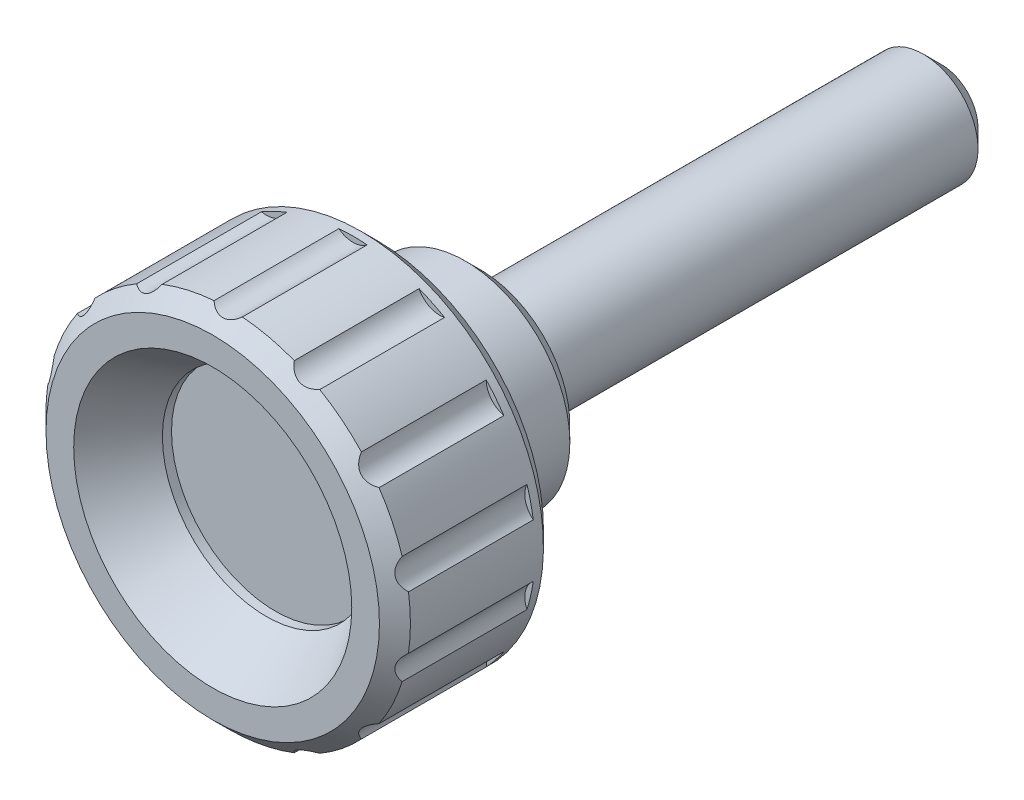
ISO-10303-21;
HEADER;
FILE_DESCRIPTION(('STEP AP214'),'2;1');
FILE_NAME('part.step','',(''),(''),'','','');
FILE_SCHEMA(('AUTOMOTIVE_DESIGN { 1 0 10303 214 1 1 1 1 }'));
ENDSEC;
DATA;
#1=APPLICATION_CONTEXT('core data for automotive mechanical design processes');
#2=APPLICATION_PROTOCOL_DEFINITION('international standard','automotive_design',2000,#1);
#3=PRODUCT_CONTEXT('',#1,'mechanical');
#4=PRODUCT('Part','Part','',(#3));
#5=PRODUCT_RELATED_PRODUCT_CATEGORY('part','',(#4));
#6=PRODUCT_DEFINITION_FORMATION('','',#4);
#7=PRODUCT_DEFINITION_CONTEXT('part definition',#1,'design');
#8=PRODUCT_DEFINITION('design','',#6,#7);
#9=PRODUCT_DEFINITION_SHAPE('','',#8);
#10=(LENGTH_UNIT() NAMED_UNIT(*) SI_UNIT(.MILLI.,.METRE.));
#11=(NAMED_UNIT(*) PLANE_ANGLE_UNIT() SI_UNIT($,.RADIAN.));
#12=(NAMED_UNIT(*) SI_UNIT($,.STERADIAN.) SOLID_ANGLE_UNIT());
#13=UNCERTAINTY_MEASURE_WITH_UNIT(LENGTH_MEASURE(1.E-05),#10,'distance_accuracy_value','');
#14=(GEOMETRIC_REPRESENTATION_CONTEXT(3) GLOBAL_UNCERTAINTY_ASSIGNED_CONTEXT((#13)) GLOBAL_UNIT_ASSIGNED_CONTEXT((#10,
#11,#12)) REPRESENTATION_CONTEXT('',''));
#15=CARTESIAN_POINT('',(0.,0.,0.));
#16=DIRECTION('',(0.,0.,1.));
#17=DIRECTION('',(1.,0.,0.));
#18=AXIS2_PLACEMENT_3D('',#15,#16,#17);
#19=CARTESIAN_POINT('',(0.,0.,0.));
#20=DIRECTION('',(0.,0.,-1.));
#21=DIRECTION('',(0.,1.,0.));
#22=AXIS2_PLACEMENT_3D('',#19,#20,#21);
#23=CYLINDRICAL_SURFACE('',#22,10.);
#24=CARTESIAN_POINT('',(0.,0.,14.15));
#25=DIRECTION('',(0.,0.,-1.));
#26=DIRECTION('',(-1.,0.,0.));
#27=AXIS2_PLACEMENT_3D('',#24,#25,#26);
#28=CIRCLE('',#27,10.);
#29=CARTESIAN_POINT('',(-8.27844244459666,-5.60958025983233,14.15));
#30=VERTEX_POINT('',#29);
#31=CARTESIAN_POINT('',(-9.54727089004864,-2.97483084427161,14.15));
#32=VERTEX_POINT('',#31);
#33=EDGE_CURVE('E226',#30,#32,#28,.T.);
#34=ORIENTED_EDGE('',*,*,#33,.T.);
#35=DIRECTION('',(0.,0.,1.));
#36=VECTOR('',#35,1.);
#37=CARTESIAN_POINT('',(-9.54727089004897,-2.97483084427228,7.3));
#38=LINE('',#37,#36);
#39=CARTESIAN_POINT('',(-9.54727089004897,-2.97483084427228,7.3));
#40=VERTEX_POINT('',#39);
#41=EDGE_CURVE('E234',#40,#32,#38,.T.);
#42=ORIENTED_EDGE('',*,*,#41,.F.);
#43=CARTESIAN_POINT('',(0.,0.,7.3));
#44=DIRECTION('',(0.,0.,1.));
#45=DIRECTION('',(0.,-1.,0.));
#46=AXIS2_PLACEMENT_3D('',#43,#44,#45);
#47=CIRCLE('',#46,10.);
#48=CARTESIAN_POINT('',(-9.89252457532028,-1.46217561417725,7.3));
#49=VERTEX_POINT('',#48);
#50=EDGE_CURVE('E407',#40,#49,#47,.F.);
#51=ORIENTED_EDGE('',*,*,#50,.T.);
#52=DIRECTION('',(0.,0.,1.));
#53=VECTOR('',#52,1.);
#54=CARTESIAN_POINT('',(-9.89252457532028,-1.46217561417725,7.3));
#55=LINE('',#54,#53);
#56=CARTESIAN_POINT('',(-9.89252457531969,-1.46217561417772,14.15));
#57=VERTEX_POINT('',#56);
#58=EDGE_CURVE('E225',#49,#57,#55,.T.);
#59=ORIENTED_EDGE('',*,*,#58,.T.);
#60=CARTESIAN_POINT('',(-9.8925245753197,1.46217561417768,14.15));
#61=VERTEX_POINT('',#60);
#62=EDGE_CURVE('E207',#57,#61,#28,.T.);
#63=ORIENTED_EDGE('',*,*,#62,.T.);
#64=DIRECTION('',(0.,0.,1.));
#65=VECTOR('',#64,1.);
#66=CARTESIAN_POINT('',(-9.89252457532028,1.46217561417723,7.3));
#67=LINE('',#66,#65);
#68=CARTESIAN_POINT('',(-9.89252457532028,1.46217561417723,7.3));
#69=VERTEX_POINT('',#68);
#70=EDGE_CURVE('E223',#69,#61,#67,.T.);
#71=ORIENTED_EDGE('',*,*,#70,.F.);
#72=CARTESIAN_POINT('',(-9.54727089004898,2.97483084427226,7.3));
#73=VERTEX_POINT('',#72);
#74=EDGE_CURVE('E621',#69,#73,#47,.F.);
#75=ORIENTED_EDGE('',*,*,#74,.T.);
#76=DIRECTION('',(0.,0.,1.));
#77=VECTOR('',#76,1.);
#78=CARTESIAN_POINT('',(-9.54727089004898,2.97483084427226,7.3));
#79=LINE('',#78,#77);
#80=CARTESIAN_POINT('',(-9.54727089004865,2.97483084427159,14.15));
#81=VERTEX_POINT('',#80);
#82=EDGE_CURVE('E232',#73,#81,#79,.T.);
#83=ORIENTED_EDGE('',*,*,#82,.T.);
#84=CARTESIAN_POINT('',(-8.27844244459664,5.60958025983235,14.15));
#85=VERTEX_POINT('',#84);
#86=EDGE_CURVE('E210',#81,#85,#28,.T.);
#87=ORIENTED_EDGE('',*,*,#86,.T.);
#88=DIRECTION('',(0.,0.,1.));
#89=VECTOR('',#88,1.);
#90=CARTESIAN_POINT('',(-8.27844244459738,5.60958025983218,7.3));
#91=LINE('',#90,#89);
#92=CARTESIAN_POINT('',(-8.27844244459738,5.60958025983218,7.3));
#93=VERTEX_POINT('',#92);
#94=EDGE_CURVE('E236',#93,#85,#91,.T.);
#95=ORIENTED_EDGE('',*,*,#94,.F.);
#96=CARTESIAN_POINT('',(-7.31106311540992,6.82263557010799,7.3));
#97=VERTEX_POINT('',#96);
#98=EDGE_CURVE('E622',#93,#97,#47,.F.);
#99=ORIENTED_EDGE('',*,*,#98,.T.);
#100=DIRECTION('',(0.,0.,1.));
#101=VECTOR('',#100,1.);
#102=CARTESIAN_POINT('',(-7.31106311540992,6.82263557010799,7.3));
#103=LINE('',#102,#101);
#104=CARTESIAN_POINT('',(-7.31106311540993,6.82263557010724,14.15));
#105=VERTEX_POINT('',#104);
#106=EDGE_CURVE('E242',#97,#105,#103,.T.);
#107=ORIENTED_EDGE('',*,*,#106,.T.);
#108=CARTESIAN_POINT('',(-5.02471325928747,8.64593873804,14.15));
#109=VERTEX_POINT('',#108);
#110=EDGE_CURVE('E591',#105,#109,#28,.T.);
#111=ORIENTED_EDGE('',*,*,#110,.T.);
#112=DIRECTION('',(0.,0.,1.));
#113=VECTOR('',#112,1.);
#114=CARTESIAN_POINT('',(-5.02471325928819,8.64593873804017,7.3));
#115=LINE('',#114,#113);
#116=CARTESIAN_POINT('',(-5.02471325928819,8.64593873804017,7.3));
#117=VERTEX_POINT('',#116);
#118=EDGE_CURVE('E245',#117,#109,#115,.T.);
#119=ORIENTED_EDGE('',*,*,#118,.F.);
#120=CARTESIAN_POINT('',(-3.62680962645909,9.3191336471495,7.3));
#121=VERTEX_POINT('',#120);
#122=EDGE_CURVE('E266',#117,#121,#47,.F.);
#123=ORIENTED_EDGE('',*,*,#122,.T.);
#124=DIRECTION('',(0.,0.,1.));
#125=VECTOR('',#124,1.);
#126=CARTESIAN_POINT('',(-3.62680962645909,9.3191336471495,7.3));
#127=LINE('',#126,#125);
#128=CARTESIAN_POINT('',(-3.62680962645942,9.31913364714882,14.15));
#129=VERTEX_POINT('',#128);
#130=EDGE_CURVE('E248',#121,#129,#127,.T.);
#131=ORIENTED_EDGE('',*,*,#130,.T.);
#132=CARTESIAN_POINT('',(-0.775777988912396,9.96986301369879,14.15));
#133=VERTEX_POINT('',#132);
#134=EDGE_CURVE('E585',#129,#133,#28,.T.);
#135=ORIENTED_EDGE('',*,*,#134,.T.);
#136=DIRECTION('',(0.,0.,1.));
#137=VECTOR('',#136,1.);
#138=CARTESIAN_POINT('',(-0.775777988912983,9.96986301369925,7.3));
#139=LINE('',#138,#137);
#140=CARTESIAN_POINT('',(-0.775777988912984,9.96986301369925,7.3));
#141=VERTEX_POINT('',#140);
#142=EDGE_CURVE('E251',#141,#133,#139,.T.);
#143=ORIENTED_EDGE('',*,*,#142,.F.);
#144=CARTESIAN_POINT('',(0.775777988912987,9.96986301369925,7.3));
#145=VERTEX_POINT('',#144);
#146=EDGE_CURVE('E41',#141,#145,#47,.F.);
#147=ORIENTED_EDGE('',*,*,#146,.T.);
#148=DIRECTION('',(0.,0.,1.));
#149=VECTOR('',#148,1.);
#150=CARTESIAN_POINT('',(0.775777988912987,9.96986301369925,7.3));
#151=LINE('',#150,#149);
#152=CARTESIAN_POINT('',(0.775777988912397,9.96986301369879,14.15));
#153=VERTEX_POINT('',#152);
#154=EDGE_CURVE('E254',#145,#153,#151,.T.);
#155=ORIENTED_EDGE('',*,*,#154,.T.);
#156=CARTESIAN_POINT('',(3.62680962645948,9.3191336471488,14.15));
#157=VERTEX_POINT('',#156);
#158=EDGE_CURVE('E588',#153,#157,#28,.T.);
#159=ORIENTED_EDGE('',*,*,#158,.T.);
#160=DIRECTION('',(0.,0.,1.));
#161=VECTOR('',#160,1.);
#162=CARTESIAN_POINT('',(3.62680962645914,9.31913364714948,7.3));
#163=LINE('',#162,#161);
#164=CARTESIAN_POINT('',(3.62680962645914,9.31913364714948,7.3));
#165=VERTEX_POINT('',#164);
#166=EDGE_CURVE('E262',#165,#157,#163,.T.);
#167=ORIENTED_EDGE('',*,*,#166,.F.);
#168=CARTESIAN_POINT('',(5.02471325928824,8.64593873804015,7.3));
#169=VERTEX_POINT('',#168);
#170=EDGE_CURVE('E267',#165,#169,#47,.F.);
#171=ORIENTED_EDGE('',*,*,#170,.T.);
#172=DIRECTION('',(0.,0.,1.));
#173=VECTOR('',#172,1.);
#174=CARTESIAN_POINT('',(5.02471325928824,8.64593873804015,7.3));
#175=LINE('',#174,#173);
#176=CARTESIAN_POINT('',(5.02471325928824,8.64593873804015,14.15));
#177=VERTEX_POINT('',#176);
#178=EDGE_CURVE('E352',#169,#177,#175,.T.);
#179=ORIENTED_EDGE('',*,*,#178,.T.);
#180=CARTESIAN_POINT('',(7.31106311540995,6.82263557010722,14.15));
#181=VERTEX_POINT('',#180);
#182=EDGE_CURVE('E34',#177,#181,#28,.T.);
#183=ORIENTED_EDGE('',*,*,#182,.T.);
#184=DIRECTION('',(0.,0.,1.));
#185=VECTOR('',#184,1.);
#186=CARTESIAN_POINT('',(7.31106311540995,6.82263557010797,7.3));
#187=LINE('',#186,#185);
#188=CARTESIAN_POINT('',(7.31106311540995,6.82263557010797,7.3));
#189=VERTEX_POINT('',#188);
#190=EDGE_CURVE('E355',#189,#181,#187,.T.);
#191=ORIENTED_EDGE('',*,*,#190,.F.);
#192=CARTESIAN_POINT('',(8.27844244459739,5.60958025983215,7.3));
#193=VERTEX_POINT('',#192);
#194=EDGE_CURVE('E598',#189,#193,#47,.F.);
#195=ORIENTED_EDGE('',*,*,#194,.T.);
#196=DIRECTION('',(0.,0.,1.));
#197=VECTOR('',#196,1.);
#198=CARTESIAN_POINT('',(8.27844244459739,5.60958025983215,7.3));
#199=LINE('',#198,#197);
#200=CARTESIAN_POINT('',(8.27844244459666,5.60958025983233,14.15));
#201=VERTEX_POINT('',#200);
#202=EDGE_CURVE('E358',#193,#201,#199,.T.);
#203=ORIENTED_EDGE('',*,*,#202,.T.);
#204=CARTESIAN_POINT('',(9.54727089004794,2.97483084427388,14.15));
#205=VERTEX_POINT('',#204);
#206=EDGE_CURVE('E686',#201,#205,#28,.T.);
#207=ORIENTED_EDGE('',*,*,#206,.T.);
#208=DIRECTION('',(0.,0.,1.));
#209=VECTOR('',#208,1.);
#210=CARTESIAN_POINT('',(9.54727089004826,2.97483084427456,7.3));
#211=LINE('',#210,#209);
#212=CARTESIAN_POINT('',(9.54727089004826,2.97483084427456,7.3));
#213=VERTEX_POINT('',#212);
#214=EDGE_CURVE('E361',#213,#205,#211,.T.);
#215=ORIENTED_EDGE('',*,*,#214,.F.);
#216=CARTESIAN_POINT('',(9.89252457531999,1.46217561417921,7.3));
#217=VERTEX_POINT('',#216);
#218=EDGE_CURVE('E600',#213,#217,#47,.F.);
#219=ORIENTED_EDGE('',*,*,#218,.T.);
#220=DIRECTION('',(0.,0.,1.));
#221=VECTOR('',#220,1.);
#222=CARTESIAN_POINT('',(9.89252457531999,1.46217561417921,7.3));
#223=LINE('',#222,#221);
#224=CARTESIAN_POINT('',(9.8925245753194,1.46217561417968,14.15));
#225=VERTEX_POINT('',#224);
#226=EDGE_CURVE('E364',#217,#225,#223,.T.);
#227=ORIENTED_EDGE('',*,*,#226,.T.);
#228=CARTESIAN_POINT('',(9.89252457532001,-1.46217561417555,14.15));
#229=VERTEX_POINT('',#228);
#230=EDGE_CURVE('E684',#225,#229,#28,.T.);
#231=ORIENTED_EDGE('',*,*,#230,.T.);
#232=DIRECTION('',(0.,0.,1.));
#233=VECTOR('',#232,1.);
#234=CARTESIAN_POINT('',(9.8925245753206,-1.46217561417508,7.3));
#235=LINE('',#234,#233);
#236=CARTESIAN_POINT('',(9.8925245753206,-1.46217561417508,7.3));
#237=VERTEX_POINT('',#236);
#238=EDGE_CURVE('E367',#237,#229,#235,.T.);
#239=ORIENTED_EDGE('',*,*,#238,.F.);
#240=CARTESIAN_POINT('',(9.54727089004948,-2.97483084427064,7.3));
#241=VERTEX_POINT('',#240);
#242=EDGE_CURVE('E603',#237,#241,#47,.F.);
#243=ORIENTED_EDGE('',*,*,#242,.T.);
#244=DIRECTION('',(0.,0.,1.));
#245=VECTOR('',#244,1.);
#246=CARTESIAN_POINT('',(9.54727089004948,-2.97483084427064,7.3));
#247=LINE('',#246,#245);
#248=CARTESIAN_POINT('',(9.54727089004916,-2.97483084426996,14.15));
#249=VERTEX_POINT('',#248);
#250=EDGE_CURVE('E370',#241,#249,#247,.T.);
#251=ORIENTED_EDGE('',*,*,#250,.T.);
#252=CARTESIAN_POINT('',(8.27844244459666,-5.60958025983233,14.15));
#253=VERTEX_POINT('',#252);
#254=EDGE_CURVE('E682',#249,#253,#28,.T.);
#255=ORIENTED_EDGE('',*,*,#254,.T.);
#256=DIRECTION('',(0.,0.,1.));
#257=VECTOR('',#256,1.);
#258=CARTESIAN_POINT('',(8.27844244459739,-5.60958025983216,7.3));
#259=LINE('',#258,#257);
#260=CARTESIAN_POINT('',(8.27844244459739,-5.60958025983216,7.3));
#261=VERTEX_POINT('',#260);
#262=EDGE_CURVE('E373',#261,#253,#259,.T.);
#263=ORIENTED_EDGE('',*,*,#262,.F.);
#264=CARTESIAN_POINT('',(7.31106311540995,-6.82263557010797,7.3));
#265=VERTEX_POINT('',#264);
#266=EDGE_CURVE('E606',#261,#265,#47,.F.);
#267=ORIENTED_EDGE('',*,*,#266,.T.);
#268=DIRECTION('',(0.,0.,1.));
#269=VECTOR('',#268,1.);
#270=CARTESIAN_POINT('',(7.31106311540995,-6.82263557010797,7.3));
#271=LINE('',#270,#269);
#272=CARTESIAN_POINT('',(7.31106311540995,-6.82263557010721,14.15));
#273=VERTEX_POINT('',#272);
#274=EDGE_CURVE('E376',#265,#273,#271,.T.);
#275=ORIENTED_EDGE('',*,*,#274,.T.);
#276=CARTESIAN_POINT('',(5.02471325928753,-8.64593873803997,14.15));
#277=VERTEX_POINT('',#276);
#278=EDGE_CURVE('E680',#273,#277,#28,.T.);
#279=ORIENTED_EDGE('',*,*,#278,.T.);
#280=DIRECTION('',(0.,0.,1.));
#281=VECTOR('',#280,1.);
#282=CARTESIAN_POINT('',(5.02471325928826,-8.64593873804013,7.3));
#283=LINE('',#282,#281);
#284=CARTESIAN_POINT('',(5.02471325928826,-8.64593873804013,7.3));
#285=VERTEX_POINT('',#284);
#286=EDGE_CURVE('E379',#285,#277,#283,.T.);
#287=ORIENTED_EDGE('',*,*,#286,.F.);
#288=CARTESIAN_POINT('',(3.62680962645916,-9.31913364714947,7.3));
#289=VERTEX_POINT('',#288);
#290=EDGE_CURVE('E609',#285,#289,#47,.F.);
#291=ORIENTED_EDGE('',*,*,#290,.T.);
#292=DIRECTION('',(0.,0.,1.));
#293=VECTOR('',#292,1.);
#294=CARTESIAN_POINT('',(3.62680962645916,-9.31913364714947,7.3));
#295=LINE('',#294,#293);
#296=CARTESIAN_POINT('',(3.62680962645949,-9.31913364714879,14.15));
#297=VERTEX_POINT('',#296);
#298=EDGE_CURVE('E382',#289,#297,#295,.T.);
#299=ORIENTED_EDGE('',*,*,#298,.T.);
#300=CARTESIAN_POINT('',(0.775777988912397,-9.96986301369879,14.15));
#301=VERTEX_POINT('',#300);
#302=EDGE_CURVE('E678',#297,#301,#28,.T.);
#303=ORIENTED_EDGE('',*,*,#302,.T.);
#304=DIRECTION('',(0.,0.,1.));
#305=VECTOR('',#304,1.);
#306=CARTESIAN_POINT('',(0.775777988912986,-9.96986301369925,7.3));
#307=LINE('',#306,#305);
#308=CARTESIAN_POINT('',(0.775777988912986,-9.96986301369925,7.3));
#309=VERTEX_POINT('',#308);
#310=EDGE_CURVE('E385',#309,#301,#307,.T.);
#311=ORIENTED_EDGE('',*,*,#310,.F.);
#312=CARTESIAN_POINT('',(-0.775777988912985,-9.96986301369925,7.3));
#313=VERTEX_POINT('',#312);
#314=EDGE_CURVE('E612',#309,#313,#47,.F.);
#315=ORIENTED_EDGE('',*,*,#314,.T.);
#316=DIRECTION('',(0.,0.,1.));
#317=VECTOR('',#316,1.);
#318=CARTESIAN_POINT('',(-0.775777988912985,-9.96986301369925,7.3));
#319=LINE('',#318,#317);
#320=CARTESIAN_POINT('',(-0.775777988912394,-9.96986301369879,14.15));
#321=VERTEX_POINT('',#320);
#322=EDGE_CURVE('E388',#313,#321,#319,.T.);
#323=ORIENTED_EDGE('',*,*,#322,.T.);
#324=CARTESIAN_POINT('',(-3.62680962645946,-9.3191336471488,14.15));
#325=VERTEX_POINT('',#324);
#326=EDGE_CURVE('E412',#321,#325,#28,.T.);
#327=ORIENTED_EDGE('',*,*,#326,.T.);
#328=DIRECTION('',(0.,0.,1.));
#329=VECTOR('',#328,1.);
#330=CARTESIAN_POINT('',(-3.62680962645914,-9.31913364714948,7.3));
#331=LINE('',#330,#329);
#332=CARTESIAN_POINT('',(-3.62680962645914,-9.31913364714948,7.3));
#333=VERTEX_POINT('',#332);
#334=EDGE_CURVE('E391',#333,#325,#331,.T.);
#335=ORIENTED_EDGE('',*,*,#334,.F.);
#336=CARTESIAN_POINT('',(-5.02471325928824,-8.64593873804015,7.3));
#337=VERTEX_POINT('',#336);
#338=EDGE_CURVE('E615',#333,#337,#47,.F.);
#339=ORIENTED_EDGE('',*,*,#338,.T.);
#340=DIRECTION('',(0.,0.,1.));
#341=VECTOR('',#340,1.);
#342=CARTESIAN_POINT('',(-5.02471325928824,-8.64593873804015,7.3));
#343=LINE('',#342,#341);
#344=CARTESIAN_POINT('',(-5.02471325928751,-8.64593873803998,14.15));
#345=VERTEX_POINT('',#344);
#346=EDGE_CURVE('E394',#337,#345,#343,.T.);
#347=ORIENTED_EDGE('',*,*,#346,.T.);
#348=CARTESIAN_POINT('',(-7.31106311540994,-6.82263557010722,14.15));
#349=VERTEX_POINT('',#348);
#350=EDGE_CURVE('E410',#345,#349,#28,.T.);
#351=ORIENTED_EDGE('',*,*,#350,.T.);
#352=DIRECTION('',(0.,0.,1.));
#353=VECTOR('',#352,1.);
#354=CARTESIAN_POINT('',(-7.31106311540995,-6.82263557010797,7.3));
#355=LINE('',#354,#353);
#356=CARTESIAN_POINT('',(-7.31106311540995,-6.82263557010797,7.3));
#357=VERTEX_POINT('',#356);
#358=EDGE_CURVE('E397',#357,#349,#355,.T.);
#359=ORIENTED_EDGE('',*,*,#358,.F.);
#360=CARTESIAN_POINT('',(-8.27844244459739,-5.60958025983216,7.3));
#361=VERTEX_POINT('',#360);
#362=EDGE_CURVE('E618',#357,#361,#47,.F.);
#363=ORIENTED_EDGE('',*,*,#362,.T.);
#364=DIRECTION('',(0.,0.,1.));
#365=VECTOR('',#364,1.);
#366=CARTESIAN_POINT('',(-8.27844244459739,-5.60958025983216,7.3));
#367=LINE('',#366,#365);
#368=EDGE_CURVE('E400',#361,#30,#367,.T.);
#369=ORIENTED_EDGE('',*,*,#368,.T.);
#370=EDGE_LOOP('',(#34,#42,#51,#59,#63,#71,#75,#83,#87,#95,#99,#107,#111,#119,#123,#131,#135,
#143,#147,#155,#159,#167,#171,#179,#183,#191,#195,#203,#207,#215,#219,#227,#231,#239,#243,#251,
#255,#263,#267,#275,#279,#287,#291,#299,#303,#311,#315,#323,#327,#335,#339,#347,#351,#359,#363,#369));
#371=FACE_BOUND('',#370,.T.);
#372=CARTESIAN_POINT('',(0.,0.,6.85));
#373=DIRECTION('',(0.,0.,-1.));
#374=DIRECTION('',(0.,1.,0.));
#375=AXIS2_PLACEMENT_3D('',#372,#373,#374);
#376=CIRCLE('',#375,10.);
#377=CARTESIAN_POINT('',(0.,10.,6.85));
#378=VERTEX_POINT('',#377);
#379=EDGE_CURVE('E258',#378,#378,#376,.T.);
#380=ORIENTED_EDGE('',*,*,#379,.F.);
#381=EDGE_LOOP('',(#380));
#382=FACE_BOUND('',#381,.T.);
#383=ADVANCED_FACE('F14',(#371,#382),#23,.T.);
#384=CARTESIAN_POINT('',(9.15,0.,6.));
#385=DIRECTION('',(0.,0.,-1.));
#386=DIRECTION('',(0.,1.,0.));
#387=AXIS2_PLACEMENT_3D('',#384,#385,#386);
#388=PLANE('',#387);
#389=CARTESIAN_POINT('',(0.,0.,6.));
#390=DIRECTION('',(0.,0.,-1.));
#391=DIRECTION('',(0.,1.,0.));
#392=AXIS2_PLACEMENT_3D('',#389,#390,#391);
#393=CIRCLE('',#392,9.15);
#394=CARTESIAN_POINT('',(0.,9.15,6.));
#395=VERTEX_POINT('',#394);
#396=EDGE_CURVE('E261',#395,#395,#393,.T.);
#397=ORIENTED_EDGE('',*,*,#396,.T.);
#398=EDGE_LOOP('',(#397));
#399=FACE_BOUND('',#398,.T.);
#400=CARTESIAN_POINT('',(0.,0.,6.));
#401=DIRECTION('',(0.,0.,-1.));
#402=DIRECTION('',(-1.,0.,0.));
#403=AXIS2_PLACEMENT_3D('',#400,#401,#402);
#404=CIRCLE('',#403,5.75);
#405=CARTESIAN_POINT('',(-5.75,0.,6.));
#406=VERTEX_POINT('',#405);
#407=EDGE_CURVE('E303',#406,#406,#404,.T.);
#408=ORIENTED_EDGE('',*,*,#407,.F.);
#409=EDGE_LOOP('',(#408));
#410=FACE_BOUND('',#409,.T.);
#411=ADVANCED_FACE('F556',(#399,#410),#388,.T.);
#412=CARTESIAN_POINT('',(0.,0.,6.));
#413=DIRECTION('',(0.,0.,1.));
#414=DIRECTION('',(0.,-1.,0.));
#415=AXIS2_PLACEMENT_3D('',#412,#413,#414);
#416=CONICAL_SURFACE('',#415,9.15,0.785398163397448);
#417=ORIENTED_EDGE('',*,*,#379,.T.);
#418=EDGE_LOOP('',(#417));
#419=FACE_BOUND('',#418,.T.);
#420=ORIENTED_EDGE('',*,*,#396,.F.);
#421=EDGE_LOOP('',(#420));
#422=FACE_BOUND('',#421,.T.);
#423=ADVANCED_FACE('F544',(#419,#422),#416,.T.);
#424=CARTESIAN_POINT('',(0.,10.9500000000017,7.3));
#425=DIRECTION('',(0.,0.,1.));
#426=DIRECTION('',(0.,-1.,0.));
#427=AXIS2_PLACEMENT_3D('',#424,#425,#426);
#428=CYLINDRICAL_SURFACE('',#427,1.25);
#429=CARTESIAN_POINT('',(0.775977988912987,9.97002134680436,14.1498266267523));
#430=CARTESIAN_POINT('',(0.734586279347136,9.93724261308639,14.1857107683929));
#431=CARTESIAN_POINT('',(0.68995529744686,9.90618033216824,14.2199249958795));
#432=CARTESIAN_POINT('',(0.593942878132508,9.84868428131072,14.2835331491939));
#433=CARTESIAN_POINT('',(0.542499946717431,9.82229852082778,14.3128768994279));
#434=CARTESIAN_POINT('',(0.443151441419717,9.78017982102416,14.3598826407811));
#435=CARTESIAN_POINT('',(0.396256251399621,9.76338583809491,14.3786950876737));
#436=CARTESIAN_POINT('',(0.299067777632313,9.73525526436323,14.4102700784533));
#437=CARTESIAN_POINT('',(0.248787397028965,9.7238991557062,14.4230542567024));
#438=CARTESIAN_POINT('',(0.145474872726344,9.70738511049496,14.4416620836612));
#439=CARTESIAN_POINT('',(0.0924231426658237,9.70228010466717,14.4474262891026));
#440=CARTESIAN_POINT('',(-0.0142000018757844,9.69894396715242,14.4511919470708));
#441=CARTESIAN_POINT('',(-0.0677715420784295,9.70071454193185,14.4491914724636));
#442=CARTESIAN_POINT('',(-0.167200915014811,9.71034496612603,14.4383278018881));
#443=CARTESIAN_POINT('',(-0.213227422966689,9.71746747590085,14.4302956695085));
#444=CARTESIAN_POINT('',(-0.30302476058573,9.7364164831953,14.4089716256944));
#445=CARTESIAN_POINT('',(-0.346794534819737,9.74824515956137,14.3956772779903));
#446=CARTESIAN_POINT('',(-0.445997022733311,9.78073865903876,14.3592589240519));
#447=CARTESIAN_POINT('',(-0.500224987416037,9.80304471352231,14.3343253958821));
#448=CARTESIAN_POINT('',(-0.602533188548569,9.8533143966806,14.2784064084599));
#449=CARTESIAN_POINT('',(-0.650605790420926,9.88128494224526,14.2474135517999));
#450=CARTESIAN_POINT('',(-0.723578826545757,9.93016500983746,14.1935419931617));
#451=CARTESIAN_POINT('',(-0.750378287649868,9.94975642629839,14.1720143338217));
#452=CARTESIAN_POINT('',(-0.775977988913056,9.97002134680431,14.1498266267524));
#453=B_SPLINE_CURVE_WITH_KNOTS('',3,(#429,#430,#431,#432,#433,#434,#435,#436,#437,#438,#439,
#440,#441,#442,#443,#444,#445,#446,#447,#448,#449,#450,#451,#452),.UNSPECIFIED.,.F.,.F.,(4,2,2,
2,2,2,2,2,2,2,2,4),(0.,0.191836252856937,0.385540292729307,0.544632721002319,0.703149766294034,
0.86299996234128,1.022889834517,1.16405643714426,1.3052884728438,1.49538818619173,
1.68572144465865,1.80423553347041),.UNSPECIFIED.);
#454=EDGE_CURVE('E526',#153,#133,#453,.T.);
#455=ORIENTED_EDGE('',*,*,#454,.F.);
#456=ORIENTED_EDGE('',*,*,#154,.F.);
#457=CARTESIAN_POINT('',(0.,10.9500000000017,7.3));
#458=DIRECTION('',(0.,0.,-1.));
#459=DIRECTION('',(0.,-1.,0.));
#460=AXIS2_PLACEMENT_3D('',#457,#458,#459);
#461=CIRCLE('',#460,1.25);
#462=EDGE_CURVE('E305',#145,#141,#461,.T.);
#463=ORIENTED_EDGE('',*,*,#462,.T.);
#464=ORIENTED_EDGE('',*,*,#142,.T.);
#465=EDGE_LOOP('',(#455,#456,#463,#464));
#466=FACE_BOUND('',#465,.T.);
#467=ADVANCED_FACE('F540',(#466),#428,.F.);
#468=CARTESIAN_POINT('',(0.,0.,7.3));
#469=DIRECTION('',(0.,0.,1.));
#470=DIRECTION('',(0.,-1.,0.));
#471=AXIS2_PLACEMENT_3D('',#468,#469,#470);
#472=PLANE('',#471);
#473=ORIENTED_EDGE('',*,*,#462,.F.);
#474=ORIENTED_EDGE('',*,*,#146,.F.);
#475=EDGE_LOOP('',(#473,#474));
#476=FACE_BOUND('',#475,.T.);
#477=ADVANCED_FACE('F536',(#476),#472,.T.);
#478=CARTESIAN_POINT('',(-4.75102694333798,9.86560910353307,7.3));
#479=DIRECTION('',(0.,0.,1.));
#480=DIRECTION('',(0.,-1.,0.));
#481=AXIS2_PLACEMENT_3D('',#478,#479,#480);
#482=CYLINDRICAL_SURFACE('',#481,1.25);
#483=CARTESIAN_POINT('',(-3.62668101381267,9.31939831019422,14.1498));
#484=CARTESIAN_POINT('',(-3.64975063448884,9.27190450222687,14.185686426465));
#485=CARTESIAN_POINT('',(-3.67648365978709,9.22455160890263,14.2199029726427));
#486=CARTESIAN_POINT('',(-3.73804039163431,9.13108688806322,14.2835157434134));
#487=CARTESIAN_POINT('',(-3.77294034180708,9.08499163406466,14.3128617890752));
#488=CARTESIAN_POINT('',(-3.84417515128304,9.00393496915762,14.3598710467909));
#489=CARTESIAN_POINT('',(-3.87913908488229,8.96845594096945,14.3786848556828));
#490=CARTESIAN_POINT('',(-3.95449665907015,8.90094031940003,14.4102625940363));
#491=CARTESIAN_POINT('',(-3.99487020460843,8.86889173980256,14.4230481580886));
#492=CARTESIAN_POINT('',(-4.08078621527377,8.80918487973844,14.4416586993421));
#493=CARTESIAN_POINT('',(-4.12636930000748,8.78156579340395,14.447424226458));
#494=CARTESIAN_POINT('',(-4.2209865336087,8.73229533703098,14.4511922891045));
#495=CARTESIAN_POINT('',(-4.27002153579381,8.71064544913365,14.4491928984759));
#496=CARTESIAN_POINT('',(-4.36378339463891,8.67617932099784,14.4383310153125));
#497=CARTESIAN_POINT('',(-4.4083422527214,8.66262548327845,14.4302997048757));
#498=CARTESIAN_POINT('',(-4.49746880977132,8.64073471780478,14.408977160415));
#499=CARTESIAN_POINT('',(-4.54203650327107,8.63240020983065,14.3956834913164));
#500=CARTESIAN_POINT('',(-4.64551253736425,8.61863194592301,14.35926702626));
#501=CARTESIAN_POINT('',(-4.70404762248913,8.61519944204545,14.3343348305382));
#502=CARTESIAN_POINT('',(-4.81803389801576,8.6160989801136,14.2784184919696));
#503=CARTESIAN_POINT('',(-4.87348120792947,8.62044057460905,14.2474269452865));
#504=CARTESIAN_POINT('',(-4.96045702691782,8.63281949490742,14.1935439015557));
#505=CARTESIAN_POINT('',(-4.99312357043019,8.63884697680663,14.1720023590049));
#506=CARTESIAN_POINT('',(-5.02500036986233,8.6460031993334,14.1498));
#507=B_SPLINE_CURVE_WITH_KNOTS('',3,(#483,#484,#485,#486,#487,#488,#489,#490,#491,#492,#493,
#494,#495,#496,#497,#498,#499,#500,#501,#502,#503,#504,#505,#506),.UNSPECIFIED.,.F.,.F.,(4,2,2,
2,2,2,2,2,2,2,2,4),(0.,0.191843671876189,0.385555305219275,0.544650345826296,0.70316998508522,
0.863022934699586,1.02291553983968,1.16408261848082,1.305315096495,1.49541104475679,
1.68574073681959,1.80433015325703),.UNSPECIFIED.);
#508=EDGE_CURVE('E520',#129,#109,#507,.T.);
#509=ORIENTED_EDGE('',*,*,#508,.F.);
#510=ORIENTED_EDGE('',*,*,#130,.F.);
#511=CARTESIAN_POINT('',(-4.75102694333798,9.86560910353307,7.3));
#512=DIRECTION('',(0.,0.,-1.));
#513=DIRECTION('',(0.,-1.,0.));
#514=AXIS2_PLACEMENT_3D('',#511,#512,#513);
#515=CIRCLE('',#514,1.25);
#516=EDGE_CURVE('E308',#121,#117,#515,.T.);
#517=ORIENTED_EDGE('',*,*,#516,.T.);
#518=ORIENTED_EDGE('',*,*,#118,.T.);
#519=EDGE_LOOP('',(#509,#510,#517,#518));
#520=FACE_BOUND('',#519,.T.);
#521=ADVANCED_FACE('F532',(#520),#482,.F.);
#522=ORIENTED_EDGE('',*,*,#516,.F.);
#523=ORIENTED_EDGE('',*,*,#122,.F.);
#524=EDGE_LOOP('',(#522,#523));
#525=FACE_BOUND('',#524,.T.);
#526=ADVANCED_FACE('F535',(#525),#472,.T.);
#527=CARTESIAN_POINT('',(-8.56105473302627,6.82721333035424,7.3));
#528=DIRECTION('',(0.,0.,1.));
#529=DIRECTION('',(0.,-1.,0.));
#530=AXIS2_PLACEMENT_3D('',#527,#528,#529);
#531=CYLINDRICAL_SURFACE('',#530,1.25);
#532=CARTESIAN_POINT('',(-7.31106207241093,6.82292982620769,14.1498));
#533=CARTESIAN_POINT('',(-7.31124029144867,6.77012985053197,14.185686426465));
#534=CARTESIAN_POINT('',(-7.31478026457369,6.7158673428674,14.2199029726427));
#535=CARTESIAN_POINT('',(-7.32968814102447,6.60495007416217,14.2835157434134));
#536=CARTESIAN_POINT('',(-7.34113192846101,6.54827716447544,14.3128617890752));
#537=CARTESIAN_POINT('',(-7.37014310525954,6.44434000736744,14.3598710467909));
#538=CARTESIAN_POINT('',(-7.38625074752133,6.39720422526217,14.3786848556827));
#539=CARTESIAN_POINT('',(-7.42485164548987,6.30367832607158,14.4102625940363));
#540=CARTESIAN_POINT('',(-7.44732159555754,6.25728612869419,14.4230481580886));
#541=CARTESIAN_POINT('',(-7.4988234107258,6.16621454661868,14.4416586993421));
#542=CARTESIAN_POINT('',(-7.52790887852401,6.1215528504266,14.447424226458));
#543=CARTESIAN_POINT('',(-7.59177841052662,6.03610882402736,14.4511922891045));
#544=CARTESIAN_POINT('',(-7.62656388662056,5.99532745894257,14.449192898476));
#545=CARTESIAN_POINT('',(-7.69608610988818,5.92359280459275,14.4383310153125));
#546=CARTESIAN_POINT('',(-7.73035146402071,5.89204785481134,14.4302997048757));
#547=CARTESIAN_POINT('',(-7.80115367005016,5.83365439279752,14.408977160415));
#548=CARTESIAN_POINT('',(-7.83769156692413,5.80680806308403,14.3956834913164));
#549=CARTESIAN_POINT('',(-7.92494642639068,5.74950671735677,14.35926702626));
#550=CARTESIAN_POINT('',(-7.97619540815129,5.72101671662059,14.3343348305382));
#551=CARTESIAN_POINT('',(-8.07928378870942,5.67237038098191,14.2784184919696));
#552=CARTESIAN_POINT('',(-8.13112383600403,5.65222433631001,14.2474269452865));
#553=CARTESIAN_POINT('',(-8.21485735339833,5.62563996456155,14.1935439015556));
#554=CARTESIAN_POINT('',(-8.24690411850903,5.61689705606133,14.1720023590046));
#555=CARTESIAN_POINT('',(-8.27872909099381,5.60951376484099,14.1497999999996));
#556=B_SPLINE_CURVE_WITH_KNOTS('',3,(#532,#533,#534,#535,#536,#537,#538,#539,#540,#541,#542,
#543,#544,#545,#546,#547,#548,#549,#550,#551,#552,#553,#554,#555),.UNSPECIFIED.,.F.,.F.,(4,2,2,
2,2,2,2,2,2,2,2,4),(0.,0.191843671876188,0.385555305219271,0.544650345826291,0.703169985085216,
0.863022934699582,1.02291553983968,1.16408261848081,1.30531509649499,1.49541104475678,
1.68574073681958,1.80433015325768),.UNSPECIFIED.);
#557=EDGE_CURVE('E214',#105,#85,#556,.T.);
#558=ORIENTED_EDGE('',*,*,#557,.F.);
#559=ORIENTED_EDGE('',*,*,#106,.F.);
#560=CARTESIAN_POINT('',(-8.56105473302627,6.82721333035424,7.3));
#561=DIRECTION('',(0.,0.,-1.));
#562=DIRECTION('',(0.,-1.,0.));
#563=AXIS2_PLACEMENT_3D('',#560,#561,#562);
#564=CIRCLE('',#563,1.25);
#565=EDGE_CURVE('E317',#97,#93,#564,.T.);
#566=ORIENTED_EDGE('',*,*,#565,.T.);
#567=ORIENTED_EDGE('',*,*,#94,.T.);
#568=EDGE_LOOP('',(#558,#559,#566,#567));
#569=FACE_BOUND('',#568,.T.);
#570=ADVANCED_FACE('F538',(#569),#531,.F.);
#571=ORIENTED_EDGE('',*,*,#565,.F.);
#572=ORIENTED_EDGE('',*,*,#98,.F.);
#573=EDGE_LOOP('',(#571,#572));
#574=FACE_BOUND('',#573,.T.);
#575=ADVANCED_FACE('F633',(#574),#472,.T.);
#576=CARTESIAN_POINT('',(-10.6754606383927,2.43660422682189,7.3));
#577=DIRECTION('',(0.,0.,1.));
#578=DIRECTION('',(0.,-1.,0.));
#579=AXIS2_PLACEMENT_3D('',#576,#577,#578);
#580=CYLINDRICAL_SURFACE('',#579,1.25);
#581=CARTESIAN_POINT('',(-9.54736632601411,2.97503084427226,14.1498493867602));
#582=CARTESIAN_POINT('',(-9.52462174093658,2.9273834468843,14.1857315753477));
#583=CARTESIAN_POINT('',(-9.50427134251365,2.87696010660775,14.2199438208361));
#584=CARTESIAN_POINT('',(-9.46958497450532,2.77056257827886,14.2835480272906));
#585=CARTESIAN_POINT('',(-9.45530948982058,2.71453912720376,14.3128898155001));
#586=CARTESIAN_POINT('',(-9.43635639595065,2.60831065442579,14.3598925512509));
#587=CARTESIAN_POINT('',(-9.43041966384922,2.55885444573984,14.3787038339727));
#588=CARTESIAN_POINT('',(-9.42462285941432,2.45784375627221,14.4102764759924));
#589=CARTESIAN_POINT('',(-9.42474088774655,2.40629751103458,14.4230594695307));
#590=CARTESIAN_POINT('',(-9.43163191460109,2.30190179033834,14.4416649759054));
#591=CARTESIAN_POINT('',(-9.43846086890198,2.24904500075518,14.4474280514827));
#592=CARTESIAN_POINT('',(-9.45893571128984,2.14435457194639,14.4511916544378));
#593=CARTESIAN_POINT('',(-9.47258329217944,2.09252119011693,14.4491902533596));
#594=CARTESIAN_POINT('',(-9.50409843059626,1.99772918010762,14.4383250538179));
#595=CARTESIAN_POINT('',(-9.52128475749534,1.95444204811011,14.4302922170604));
#596=CARTESIAN_POINT('',(-9.55974139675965,1.8711137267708,14.4089668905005));
#597=CARTESIAN_POINT('',(-9.58101359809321,1.83107405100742,14.3956719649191));
#598=CARTESIAN_POINT('',(-9.63476844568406,1.7415896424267,14.3592520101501));
#599=CARTESIAN_POINT('',(-9.66858315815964,1.69368480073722,14.3343173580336));
#600=CARTESIAN_POINT('',(-9.74036028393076,1.60512785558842,14.2783961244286));
#601=CARTESIAN_POINT('',(-9.77832774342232,1.56448473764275,14.2474021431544));
#602=CARTESIAN_POINT('',(-9.84222639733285,1.50421436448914,14.1935250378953));
#603=CARTESIAN_POINT('',(-9.86729531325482,1.48244282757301,14.1719926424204));
#604=CARTESIAN_POINT('',(-9.89275398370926,1.46199133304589,14.1497999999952));
#605=B_SPLINE_CURVE_WITH_KNOTS('',3,(#581,#582,#583,#584,#585,#586,#587,#588,#589,#590,#591,
#592,#593,#594,#595,#596,#597,#598,#599,#600,#601,#602,#603,#604),.UNSPECIFIED.,.F.,.F.,(4,2,2,
2,2,2,2,2,2,2,2,4),(0.,0.191829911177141,0.385527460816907,0.54461765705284,0.703132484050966,
0.862980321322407,1.02286786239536,1.16403407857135,1.30526571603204,1.49536852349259,
1.68570495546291,1.80424243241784),.UNSPECIFIED.);
#606=EDGE_CURVE('E203',#81,#61,#605,.T.);
#607=ORIENTED_EDGE('',*,*,#606,.F.);
#608=ORIENTED_EDGE('',*,*,#82,.F.);
#609=CARTESIAN_POINT('',(-10.6754606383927,2.43660422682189,7.3));
#610=DIRECTION('',(0.,0.,-1.));
#611=DIRECTION('',(0.,-1.,0.));
#612=AXIS2_PLACEMENT_3D('',#609,#610,#611);
#613=CIRCLE('',#612,1.25);
#614=EDGE_CURVE('E231',#73,#69,#613,.T.);
#615=ORIENTED_EDGE('',*,*,#614,.T.);
#616=ORIENTED_EDGE('',*,*,#70,.T.);
#617=EDGE_LOOP('',(#607,#608,#615,#616));
#618=FACE_BOUND('',#617,.T.);
#619=ADVANCED_FACE('F229',(#618),#580,.F.);
#620=ORIENTED_EDGE('',*,*,#614,.F.);
#621=ORIENTED_EDGE('',*,*,#74,.F.);
#622=EDGE_LOOP('',(#620,#621));
#623=FACE_BOUND('',#622,.T.);
#624=ADVANCED_FACE('F635',(#623),#472,.T.);
#625=CARTESIAN_POINT('',(-10.6754606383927,-2.43660422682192,7.3));
#626=DIRECTION('',(0.,0.,1.));
#627=DIRECTION('',(0.,-1.,0.));
#628=AXIS2_PLACEMENT_3D('',#625,#626,#627);
#629=CYLINDRICAL_SURFACE('',#628,1.25);
#630=CARTESIAN_POINT('',(-9.89275398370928,-1.46199133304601,14.1497999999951));
#631=CARTESIAN_POINT('',(-9.85158441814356,-1.49505091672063,14.185686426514));
#632=CARTESIAN_POINT('',(-9.81136741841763,-1.53165069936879,14.2199029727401));
#633=CARTESIAN_POINT('',(-9.73394371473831,-1.61246193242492,14.283515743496));
#634=CARTESIAN_POINT('',(-9.69677013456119,-1.65674402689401,14.3128617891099));
#635=CARTESIAN_POINT('',(-9.63359696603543,-1.74422963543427,14.3598710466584));
#636=CARTESIAN_POINT('',(-9.60678767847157,-1.78621177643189,14.3786848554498));
#637=CARTESIAN_POINT('',(-9.55773345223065,-1.87470361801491,14.4102625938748));
#638=CARTESIAN_POINT('',(-9.53547235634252,-1.92119639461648,14.4230481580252));
#639=CARTESIAN_POINT('',(-9.49638058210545,-2.01824433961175,14.4416586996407));
#640=CARTESIAN_POINT('',(-9.47959715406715,-2.06883038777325,14.4474242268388));
#641=CARTESIAN_POINT('',(-9.45261632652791,-2.17203907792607,14.4511922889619));
#642=CARTESIAN_POINT('',(-9.44242056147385,-2.22466222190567,14.4491928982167));
#643=CARTESIAN_POINT('',(-9.42968254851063,-2.32374270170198,14.438331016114));
#644=CARTESIAN_POINT('',(-9.42638381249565,-2.37020038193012,14.4302997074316));
#645=CARTESIAN_POINT('',(-9.42487441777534,-2.46196350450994,14.4089771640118));
#646=CARTESIAN_POINT('',(-9.42666611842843,-2.50726840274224,14.3956834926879));
#647=CARTESIAN_POINT('',(-9.43626864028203,-2.61121384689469,14.3592670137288));
#648=CARTESIAN_POINT('',(-9.44594748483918,-2.66904517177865,14.3343348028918));
#649=CARTESIAN_POINT('',(-9.47218881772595,-2.77997341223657,14.2784184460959));
#650=CARTESIAN_POINT('',(-9.48875974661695,-2.83306442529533,14.2474269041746));
#651=CARTESIAN_POINT('',(-9.52017328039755,-2.9150816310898,14.1935592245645));
#652=CARTESIAN_POINT('',(-9.53330808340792,-2.94556603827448,14.1720342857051));
#653=CARTESIAN_POINT('',(-9.54736632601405,-2.97503084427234,14.1498493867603));
#654=B_SPLINE_CURVE_WITH_KNOTS('',3,(#630,#631,#632,#633,#634,#635,#636,#637,#638,#639,#640,
#641,#642,#643,#644,#645,#646,#647,#648,#649,#650,#651,#652,#653),.UNSPECIFIED.,.F.,.F.,(4,2,2,
2,2,2,2,2,2,2,2,4),(0.,0.191843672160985,0.385555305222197,0.544650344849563,0.703169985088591,
0.863022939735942,1.02291553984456,1.16408259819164,1.30531509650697,1.49541116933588,
1.68574073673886,1.80424237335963),.UNSPECIFIED.);
#655=EDGE_CURVE('E215',#57,#32,#654,.T.);
#656=ORIENTED_EDGE('',*,*,#655,.F.);
#657=ORIENTED_EDGE('',*,*,#58,.F.);
#658=CARTESIAN_POINT('',(-10.6754606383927,-2.43660422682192,7.3));
#659=DIRECTION('',(0.,0.,-1.));
#660=DIRECTION('',(0.,-1.,0.));
#661=AXIS2_PLACEMENT_3D('',#658,#659,#660);
#662=CIRCLE('',#661,1.25);
#663=EDGE_CURVE('E321',#49,#40,#662,.T.);
#664=ORIENTED_EDGE('',*,*,#663,.T.);
#665=ORIENTED_EDGE('',*,*,#41,.T.);
#666=EDGE_LOOP('',(#656,#657,#664,#665));
#667=FACE_BOUND('',#666,.T.);
#668=ADVANCED_FACE('F405',(#667),#629,.F.);
#669=ORIENTED_EDGE('',*,*,#663,.F.);
#670=ORIENTED_EDGE('',*,*,#50,.F.);
#671=EDGE_LOOP('',(#669,#670));
#672=FACE_BOUND('',#671,.T.);
#673=ADVANCED_FACE('F644',(#672),#472,.T.);
#674=CARTESIAN_POINT('',(-8.56105473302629,-6.82721333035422,7.3));
#675=DIRECTION('',(0.,0.,1.));
#676=DIRECTION('',(0.,-1.,0.));
#677=AXIS2_PLACEMENT_3D('',#674,#675,#676);
#678=CYLINDRICAL_SURFACE('',#677,1.25);
#679=CARTESIAN_POINT('',(-8.27872909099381,-5.60951376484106,14.1497999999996));
#680=CARTESIAN_POINT('',(-8.22729257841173,-5.62143661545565,14.1856864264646));
#681=CARTESIAN_POINT('',(-8.17517826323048,-5.63696237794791,14.2199029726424));
#682=CARTESIAN_POINT('',(-8.07035923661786,-5.67617789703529,14.2835157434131));
#683=CARTESIAN_POINT('',(-8.01765371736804,-5.69994567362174,14.3128617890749));
#684=CARTESIAN_POINT('',(-7.92277807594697,-5.75135767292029,14.3598710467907));
#685=CARTESIAN_POINT('',(-7.88040837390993,-5.77755016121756,14.3786848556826));
#686=CARTESIAN_POINT('',(-7.79781687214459,-5.83599472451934,14.4102625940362));
#687=CARTESIAN_POINT('',(-7.75758785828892,-5.86822454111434,14.4230481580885));
#688=CARTESIAN_POINT('',(-7.68025986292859,-5.93870043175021,14.4416586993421));
#689=CARTESIAN_POINT('',(-7.64319005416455,-5.97699482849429,14.447424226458));
#690=CARTESIAN_POINT('',(-7.57410059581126,-6.05827610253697,14.4511922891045));
#691=CARTESIAN_POINT('',(-7.54208220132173,-6.10126414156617,14.449192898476));
#692=CARTESIAN_POINT('',(-7.48761623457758,-6.18500575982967,14.4383310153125));
#693=CARTESIAN_POINT('',(-7.46448694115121,-6.22543142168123,14.4302997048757));
#694=CARTESIAN_POINT('',(-7.42331249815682,-6.30745223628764,14.408977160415));
#695=CARTESIAN_POINT('',(-7.40526970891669,-6.34904792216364,14.3956834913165));
#696=CARTESIAN_POINT('',(-7.3688210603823,-6.44686586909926,14.3592670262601));
#697=CARTESIAN_POINT('',(-7.35244933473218,-6.50316955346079,14.3343348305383));
#698=CARTESIAN_POINT('',(-7.32796198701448,-6.61449812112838,14.2784184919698));
#699=CARTESIAN_POINT('',(-7.3198565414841,-6.66952134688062,14.2474269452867));
#700=CARTESIAN_POINT('',(-7.31257115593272,-6.7570710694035,14.1935439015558));
#701=CARTESIAN_POINT('',(-7.31117852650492,-6.79025983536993,14.172002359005));
#702=CARTESIAN_POINT('',(-7.31106207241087,-6.8229298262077,14.1498));
#703=B_SPLINE_CURVE_WITH_KNOTS('',3,(#679,#680,#681,#682,#683,#684,#685,#686,#687,#688,#689,
#690,#691,#692,#693,#694,#695,#696,#697,#698,#699,#700,#701,#702),.UNSPECIFIED.,.F.,.F.,(4,2,2,
2,2,2,2,2,2,2,2,4),(0.,0.191843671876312,0.38555530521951,0.544650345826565,0.703169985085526,
0.863022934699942,1.02291553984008,1.16408261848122,1.30531509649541,1.49541104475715,
1.68574073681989,1.8043301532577),.UNSPECIFIED.);
#704=EDGE_CURVE('E494',#30,#349,#703,.T.);
#705=ORIENTED_EDGE('',*,*,#704,.F.);
#706=ORIENTED_EDGE('',*,*,#368,.F.);
#707=CARTESIAN_POINT('',(-8.56105473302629,-6.82721333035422,7.3));
#708=DIRECTION('',(0.,0.,-1.));
#709=DIRECTION('',(0.,-1.,0.));
#710=AXIS2_PLACEMENT_3D('',#707,#708,#709);
#711=CIRCLE('',#710,1.25);
#712=EDGE_CURVE('E324',#361,#357,#711,.T.);
#713=ORIENTED_EDGE('',*,*,#712,.T.);
#714=ORIENTED_EDGE('',*,*,#358,.T.);
#715=EDGE_LOOP('',(#705,#706,#713,#714));
#716=FACE_BOUND('',#715,.T.);
#717=ADVANCED_FACE('F650',(#716),#678,.F.);
#718=ORIENTED_EDGE('',*,*,#712,.F.);
#719=ORIENTED_EDGE('',*,*,#362,.F.);
#720=EDGE_LOOP('',(#718,#719));
#721=FACE_BOUND('',#720,.T.);
#722=ADVANCED_FACE('F652',(#721),#472,.T.);
#723=CARTESIAN_POINT('',(-4.75102694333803,-9.86560910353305,7.3));
#724=DIRECTION('',(0.,0.,1.));
#725=DIRECTION('',(0.,-1.,0.));
#726=AXIS2_PLACEMENT_3D('',#723,#724,#725);
#727=CYLINDRICAL_SURFACE('',#726,1.25);
#728=CARTESIAN_POINT('',(-5.02500036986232,-8.64600319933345,14.1498));
#729=CARTESIAN_POINT('',(-4.97348454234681,-8.63442785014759,14.185686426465));
#730=CARTESIAN_POINT('',(-4.91979479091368,-8.6258045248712,14.2199029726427));
#731=CARTESIAN_POINT('',(-4.80834113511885,-8.61565721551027,14.2835157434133));
#732=CARTESIAN_POINT('',(-4.75054265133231,-8.61420317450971,14.3128617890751));
#733=CARTESIAN_POINT('',(-4.64275582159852,-8.6193587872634,14.3598710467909));
#734=CARTESIAN_POINT('',(-4.59321754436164,-8.62457387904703,14.3786848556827));
#735=CARTESIAN_POINT('',(-4.49344702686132,-8.64139550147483,14.4102625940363));
#736=CARTESIAN_POINT('',(-4.44321794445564,-8.65297884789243,14.4230481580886));
#737=CARTESIAN_POINT('',(-4.34296948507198,-8.68292407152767,14.4416586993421));
#738=CARTESIAN_POINT('',(-4.29295542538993,-8.70134214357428,14.447424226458));
#739=CARTESIAN_POINT('',(-4.19544135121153,-8.74459724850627,14.4511922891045));
#740=CARTESIAN_POINT('',(-4.14794196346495,-8.76943587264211,14.449192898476));
#741=CARTESIAN_POINT('',(-4.06253569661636,-8.8212525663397,14.4383310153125));
#742=CARTESIAN_POINT('',(-4.02415688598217,-8.84763940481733,14.4302997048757));
#743=CARTESIAN_POINT('',(-3.95147249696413,-8.90367268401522,14.408977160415));
#744=CARTESIAN_POINT('',(-3.91716881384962,-8.93332062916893,14.3956834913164));
#745=CARTESIAN_POINT('',(-3.8418880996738,-9.00563707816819,14.35926702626));
#746=CARTESIAN_POINT('',(-3.80270843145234,-9.04926151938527,14.3343348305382));
#747=CARTESIAN_POINT('',(-3.73234243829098,-9.13894043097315,14.2784184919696));
#748=CARTESIAN_POINT('',(-3.70116600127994,-9.18499782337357,14.2474269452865));
#749=CARTESIAN_POINT('',(-3.65661569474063,-9.26071638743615,14.1935439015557));
#750=CARTESIAN_POINT('',(-3.64096091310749,-9.29001419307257,14.1720023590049));
#751=CARTESIAN_POINT('',(-3.62668101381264,-9.31939831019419,14.1498));
#752=B_SPLINE_CURVE_WITH_KNOTS('',3,(#728,#729,#730,#731,#732,#733,#734,#735,#736,#737,#738,
#739,#740,#741,#742,#743,#744,#745,#746,#747,#748,#749,#750,#751),.UNSPECIFIED.,.F.,.F.,(4,2,2,
2,2,2,2,2,2,2,2,4),(0.,0.191843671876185,0.385555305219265,0.544650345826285,0.70316998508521,
0.863022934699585,1.02291553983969,1.16408261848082,1.305315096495,1.49541104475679,
1.68574073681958,1.804330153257),.UNSPECIFIED.);
#753=EDGE_CURVE('E486',#345,#325,#752,.T.);
#754=ORIENTED_EDGE('',*,*,#753,.F.);
#755=ORIENTED_EDGE('',*,*,#346,.F.);
#756=CARTESIAN_POINT('',(-4.75102694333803,-9.86560910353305,7.3));
#757=DIRECTION('',(0.,0.,-1.));
#758=DIRECTION('',(0.,-1.,0.));
#759=AXIS2_PLACEMENT_3D('',#756,#757,#758);
#760=CIRCLE('',#759,1.25);
#761=EDGE_CURVE('E327',#337,#333,#760,.T.);
#762=ORIENTED_EDGE('',*,*,#761,.T.);
#763=ORIENTED_EDGE('',*,*,#334,.T.);
#764=EDGE_LOOP('',(#754,#755,#762,#763));
#765=FACE_BOUND('',#764,.T.);
#766=ADVANCED_FACE('F659',(#765),#727,.F.);
#767=ORIENTED_EDGE('',*,*,#761,.F.);
#768=ORIENTED_EDGE('',*,*,#338,.F.);
#769=EDGE_LOOP('',(#767,#768));
#770=FACE_BOUND('',#769,.T.);
#771=ADVANCED_FACE('F552',(#770),#472,.T.);
#772=CARTESIAN_POINT('',(0.,-10.9500000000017,7.3));
#773=DIRECTION('',(0.,0.,1.));
#774=DIRECTION('',(0.,-1.,0.));
#775=AXIS2_PLACEMENT_3D('',#772,#773,#774);
#776=CYLINDRICAL_SURFACE('',#775,1.25);
#777=CARTESIAN_POINT('',(-0.775977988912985,-9.97002134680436,14.1498266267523));
#778=CARTESIAN_POINT('',(-0.734586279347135,-9.93724261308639,14.1857107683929));
#779=CARTESIAN_POINT('',(-0.689955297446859,-9.90618033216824,14.2199249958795));
#780=CARTESIAN_POINT('',(-0.593942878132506,-9.84868428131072,14.2835331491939));
#781=CARTESIAN_POINT('',(-0.542499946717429,-9.82229852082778,14.3128768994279));
#782=CARTESIAN_POINT('',(-0.443151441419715,-9.78017982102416,14.3598826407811));
#783=CARTESIAN_POINT('',(-0.396256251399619,-9.76338583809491,14.3786950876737));
#784=CARTESIAN_POINT('',(-0.299067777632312,-9.73525526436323,14.4102700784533));
#785=CARTESIAN_POINT('',(-0.248787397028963,-9.7238991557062,14.4230542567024));
#786=CARTESIAN_POINT('',(-0.145474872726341,-9.70738511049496,14.4416620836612));
#787=CARTESIAN_POINT('',(-0.0924231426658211,-9.70228010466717,14.4474262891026));
#788=CARTESIAN_POINT('',(0.0142000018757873,-9.69894396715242,14.4511919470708));
#789=CARTESIAN_POINT('',(0.0677715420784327,-9.70071454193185,14.4491914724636));
#790=CARTESIAN_POINT('',(0.167200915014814,-9.71034496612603,14.4383278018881));
#791=CARTESIAN_POINT('',(0.213227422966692,-9.71746747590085,14.4302956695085));
#792=CARTESIAN_POINT('',(0.303024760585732,-9.7364164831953,14.4089716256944));
#793=CARTESIAN_POINT('',(0.346794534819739,-9.74824515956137,14.3956772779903));
#794=CARTESIAN_POINT('',(0.445997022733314,-9.78073865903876,14.3592589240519));
#795=CARTESIAN_POINT('',(0.500224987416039,-9.80304471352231,14.3343253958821));
#796=CARTESIAN_POINT('',(0.60253318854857,-9.8533143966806,14.2784064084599));
#797=CARTESIAN_POINT('',(0.650605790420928,-9.88128494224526,14.2474135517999));
#798=CARTESIAN_POINT('',(0.723578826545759,-9.93016500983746,14.1935419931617));
#799=CARTESIAN_POINT('',(0.75037828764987,-9.94975642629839,14.1720143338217));
#800=CARTESIAN_POINT('',(0.775977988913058,-9.97002134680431,14.1498266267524));
#801=B_SPLINE_CURVE_WITH_KNOTS('',3,(#777,#778,#779,#780,#781,#782,#783,#784,#785,#786,#787,
#788,#789,#790,#791,#792,#793,#794,#795,#796,#797,#798,#799,#800),.UNSPECIFIED.,.F.,.F.,(4,2,2,
2,2,2,2,2,2,2,2,4),(0.,0.191836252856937,0.385540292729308,0.544632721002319,0.703149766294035,
0.862999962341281,1.022889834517,1.16405643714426,1.3052884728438,1.49538818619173,
1.68572144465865,1.80423553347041),.UNSPECIFIED.);
#802=EDGE_CURVE('E478',#321,#301,#801,.T.);
#803=ORIENTED_EDGE('',*,*,#802,.F.);
#804=ORIENTED_EDGE('',*,*,#322,.F.);
#805=CARTESIAN_POINT('',(0.,-10.9500000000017,7.3));
#806=DIRECTION('',(0.,0.,-1.));
#807=DIRECTION('',(0.,-1.,0.));
#808=AXIS2_PLACEMENT_3D('',#805,#806,#807);
#809=CIRCLE('',#808,1.25);
#810=EDGE_CURVE('E330',#313,#309,#809,.T.);
#811=ORIENTED_EDGE('',*,*,#810,.T.);
#812=ORIENTED_EDGE('',*,*,#310,.T.);
#813=EDGE_LOOP('',(#803,#804,#811,#812));
#814=FACE_BOUND('',#813,.T.);
#815=ADVANCED_FACE('F550',(#814),#776,.F.);
#816=ORIENTED_EDGE('',*,*,#810,.F.);
#817=ORIENTED_EDGE('',*,*,#314,.F.);
#818=EDGE_LOOP('',(#816,#817));
#819=FACE_BOUND('',#818,.T.);
#820=ADVANCED_FACE('F546',(#819),#472,.T.);
#821=CARTESIAN_POINT('',(4.75102694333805,-9.86560910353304,7.3));
#822=DIRECTION('',(0.,0.,1.));
#823=DIRECTION('',(0.,-1.,0.));
#824=AXIS2_PLACEMENT_3D('',#821,#822,#823);
#825=CYLINDRICAL_SURFACE('',#824,1.25);
#826=CARTESIAN_POINT('',(3.62668101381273,-9.31939831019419,14.1498));
#827=CARTESIAN_POINT('',(3.64975063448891,-9.27190450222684,14.185686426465));
#828=CARTESIAN_POINT('',(3.67648365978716,-9.2245516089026,14.2199029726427));
#829=CARTESIAN_POINT('',(3.73804039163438,-9.13108688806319,14.2835157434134));
#830=CARTESIAN_POINT('',(3.77294034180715,-9.08499163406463,14.3128617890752));
#831=CARTESIAN_POINT('',(3.8441751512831,-9.00393496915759,14.3598710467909));
#832=CARTESIAN_POINT('',(3.87913908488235,-8.96845594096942,14.3786848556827));
#833=CARTESIAN_POINT('',(3.95449665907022,-8.9009403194,14.4102625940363));
#834=CARTESIAN_POINT('',(3.9948702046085,-8.86889173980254,14.4230481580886));
#835=CARTESIAN_POINT('',(4.08078621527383,-8.80918487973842,14.4416586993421));
#836=CARTESIAN_POINT('',(4.12636930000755,-8.78156579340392,14.447424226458));
#837=CARTESIAN_POINT('',(4.22098653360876,-8.73229533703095,14.4511922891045));
#838=CARTESIAN_POINT('',(4.27002153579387,-8.71064544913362,14.449192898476));
#839=CARTESIAN_POINT('',(4.36378339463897,-8.67617932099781,14.4383310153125));
#840=CARTESIAN_POINT('',(4.40834225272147,-8.66262548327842,14.4302997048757));
#841=CARTESIAN_POINT('',(4.49746880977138,-8.64073471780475,14.408977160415));
#842=CARTESIAN_POINT('',(4.54203650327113,-8.63240020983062,14.3956834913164));
#843=CARTESIAN_POINT('',(4.64551253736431,-8.61863194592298,14.35926702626));
#844=CARTESIAN_POINT('',(4.70404762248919,-8.61519944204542,14.3343348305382));
#845=CARTESIAN_POINT('',(4.81803389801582,-8.61609898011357,14.2784184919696));
#846=CARTESIAN_POINT('',(4.87348120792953,-8.62044057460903,14.2474269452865));
#847=CARTESIAN_POINT('',(4.96045702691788,-8.63281949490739,14.1935439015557));
#848=CARTESIAN_POINT('',(4.99312357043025,-8.6388469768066,14.1720023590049));
#849=CARTESIAN_POINT('',(5.02500036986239,-8.64600319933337,14.1498));
#850=B_SPLINE_CURVE_WITH_KNOTS('',3,(#826,#827,#828,#829,#830,#831,#832,#833,#834,#835,#836,
#837,#838,#839,#840,#841,#842,#843,#844,#845,#846,#847,#848,#849),.UNSPECIFIED.,.F.,.F.,(4,2,2,
2,2,2,2,2,2,2,2,4),(0.,0.191843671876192,0.385555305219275,0.544650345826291,0.703169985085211,
0.863022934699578,1.02291553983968,1.16408261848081,1.30531509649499,1.49541104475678,
1.68574073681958,1.80433015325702),.UNSPECIFIED.);
#851=EDGE_CURVE('E470',#297,#277,#850,.T.);
#852=ORIENTED_EDGE('',*,*,#851,.F.);
#853=ORIENTED_EDGE('',*,*,#298,.F.);
#854=CARTESIAN_POINT('',(4.75102694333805,-9.86560910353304,7.3));
#855=DIRECTION('',(0.,0.,-1.));
#856=DIRECTION('',(0.,-1.,0.));
#857=AXIS2_PLACEMENT_3D('',#854,#855,#856);
#858=CIRCLE('',#857,1.25);
#859=EDGE_CURVE('E333',#289,#285,#858,.T.);
#860=ORIENTED_EDGE('',*,*,#859,.T.);
#861=ORIENTED_EDGE('',*,*,#286,.T.);
#862=EDGE_LOOP('',(#852,#853,#860,#861));
#863=FACE_BOUND('',#862,.T.);
#864=ADVANCED_FACE('F549',(#863),#825,.F.);
#865=ORIENTED_EDGE('',*,*,#859,.F.);
#866=ORIENTED_EDGE('',*,*,#290,.F.);
#867=EDGE_LOOP('',(#865,#866));
#868=FACE_BOUND('',#867,.T.);
#869=ADVANCED_FACE('F553',(#868),#472,.T.);
#870=CARTESIAN_POINT('',(8.56105473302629,-6.82721333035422,7.3));
#871=DIRECTION('',(0.,0.,1.));
#872=DIRECTION('',(0.,-1.,0.));
#873=AXIS2_PLACEMENT_3D('',#870,#871,#872);
#874=CYLINDRICAL_SURFACE('',#873,1.25);
#875=CARTESIAN_POINT('',(7.31106207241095,-6.82292982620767,14.1498));
#876=CARTESIAN_POINT('',(7.31124029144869,-6.77012985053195,14.185686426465));
#877=CARTESIAN_POINT('',(7.31478026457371,-6.71586734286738,14.2199029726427));
#878=CARTESIAN_POINT('',(7.32968814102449,-6.60495007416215,14.2835157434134));
#879=CARTESIAN_POINT('',(7.34113192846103,-6.54827716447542,14.3128617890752));
#880=CARTESIAN_POINT('',(7.37014310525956,-6.44434000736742,14.3598710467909));
#881=CARTESIAN_POINT('',(7.38625074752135,-6.39720422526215,14.3786848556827));
#882=CARTESIAN_POINT('',(7.42485164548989,-6.30367832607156,14.4102625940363));
#883=CARTESIAN_POINT('',(7.44732159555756,-6.25728612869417,14.4230481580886));
#884=CARTESIAN_POINT('',(7.49882341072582,-6.16621454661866,14.4416586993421));
#885=CARTESIAN_POINT('',(7.52790887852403,-6.12155285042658,14.447424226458));
#886=CARTESIAN_POINT('',(7.59177841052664,-6.03610882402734,14.4511922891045));
#887=CARTESIAN_POINT('',(7.62656388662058,-5.99532745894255,14.449192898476));
#888=CARTESIAN_POINT('',(7.6960861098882,-5.92359280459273,14.4383310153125));
#889=CARTESIAN_POINT('',(7.73035146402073,-5.89204785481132,14.4302997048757));
#890=CARTESIAN_POINT('',(7.80115367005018,-5.8336543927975,14.408977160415));
#891=CARTESIAN_POINT('',(7.83769156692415,-5.80680806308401,14.3956834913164));
#892=CARTESIAN_POINT('',(7.9249464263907,-5.74950671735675,14.35926702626));
#893=CARTESIAN_POINT('',(7.97619540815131,-5.72101671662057,14.3343348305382));
#894=CARTESIAN_POINT('',(8.07928378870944,-5.67237038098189,14.2784184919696));
#895=CARTESIAN_POINT('',(8.13112383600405,-5.65222433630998,14.2474269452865));
#896=CARTESIAN_POINT('',(8.21485735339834,-5.62563996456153,14.1935439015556));
#897=CARTESIAN_POINT('',(8.24690411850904,-5.61689705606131,14.1720023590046));
#898=CARTESIAN_POINT('',(8.27872909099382,-5.60951376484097,14.1497999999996));
#899=B_SPLINE_CURVE_WITH_KNOTS('',3,(#875,#876,#877,#878,#879,#880,#881,#882,#883,#884,#885,
#886,#887,#888,#889,#890,#891,#892,#893,#894,#895,#896,#897,#898),.UNSPECIFIED.,.F.,.F.,(4,2,2,
2,2,2,2,2,2,2,2,4),(0.,0.19184367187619,0.385555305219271,0.544650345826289,0.703169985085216,
0.863022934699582,1.02291553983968,1.16408261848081,1.30531509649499,1.49541104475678,
1.68574073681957,1.80433015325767),.UNSPECIFIED.);
#900=EDGE_CURVE('E462',#273,#253,#899,.T.);
#901=ORIENTED_EDGE('',*,*,#900,.F.);
#902=ORIENTED_EDGE('',*,*,#274,.F.);
#903=CARTESIAN_POINT('',(8.56105473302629,-6.82721333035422,7.3));
#904=DIRECTION('',(0.,0.,-1.));
#905=DIRECTION('',(0.,-1.,0.));
#906=AXIS2_PLACEMENT_3D('',#903,#904,#905);
#907=CIRCLE('',#906,1.25);
#908=EDGE_CURVE('E336',#265,#261,#907,.T.);
#909=ORIENTED_EDGE('',*,*,#908,.T.);
#910=ORIENTED_EDGE('',*,*,#262,.T.);
#911=EDGE_LOOP('',(#901,#902,#909,#910));
#912=FACE_BOUND('',#911,.T.);
#913=ADVANCED_FACE('F721',(#912),#874,.F.);
#914=ORIENTED_EDGE('',*,*,#908,.F.);
#915=ORIENTED_EDGE('',*,*,#266,.F.);
#916=EDGE_LOOP('',(#914,#915));
#917=FACE_BOUND('',#916,.T.);
#918=ADVANCED_FACE('F713',(#917),#472,.T.);
#919=CARTESIAN_POINT('',(10.675460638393,-2.43660422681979,7.3));
#920=DIRECTION('',(0.,0.,1.));
#921=DIRECTION('',(0.,-1.,0.));
#922=AXIS2_PLACEMENT_3D('',#919,#920,#921);
#923=CYLINDRICAL_SURFACE('',#922,1.25);
#924=CARTESIAN_POINT('',(9.54736632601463,-2.97503084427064,14.1498493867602));
#925=CARTESIAN_POINT('',(9.52462174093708,-2.92738344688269,14.1857315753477));
#926=CARTESIAN_POINT('',(9.50427134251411,-2.87696010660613,14.2199438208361));
#927=CARTESIAN_POINT('',(9.46958497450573,-2.77056257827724,14.2835480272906));
#928=CARTESIAN_POINT('',(9.45530948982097,-2.71453912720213,14.3128898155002));
#929=CARTESIAN_POINT('',(9.436356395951,-2.60831065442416,14.359892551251));
#930=CARTESIAN_POINT('',(9.43041966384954,-2.5588544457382,14.3787038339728));
#931=CARTESIAN_POINT('',(9.42462285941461,-2.45784375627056,14.4102764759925));
#932=CARTESIAN_POINT('',(9.42474088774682,-2.40629751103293,14.4230594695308));
#933=CARTESIAN_POINT('',(9.43163191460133,-2.30190179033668,14.4416649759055));
#934=CARTESIAN_POINT('',(9.4384608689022,-2.24904500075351,14.4474280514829));
#935=CARTESIAN_POINT('',(9.45893571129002,-2.1443545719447,14.451191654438));
#936=CARTESIAN_POINT('',(9.4725832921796,-2.09252119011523,14.4491902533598));
#937=CARTESIAN_POINT('',(9.50409843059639,-1.9977291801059,14.4383250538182));
#938=CARTESIAN_POINT('',(9.52128475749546,-1.95444204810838,14.4302922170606));
#939=CARTESIAN_POINT('',(9.55974139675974,-1.87111372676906,14.4089668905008));
#940=CARTESIAN_POINT('',(9.58101359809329,-1.83107405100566,14.3956719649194));
#941=CARTESIAN_POINT('',(9.63476844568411,-1.74158964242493,14.3592520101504));
#942=CARTESIAN_POINT('',(9.66858315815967,-1.69368480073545,14.3343173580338));
#943=CARTESIAN_POINT('',(9.74036028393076,-1.60512785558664,14.2783961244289));
#944=CARTESIAN_POINT('',(9.7783277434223,-1.56448473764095,14.2474021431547));
#945=CARTESIAN_POINT('',(9.84222639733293,-1.50421436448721,14.1935250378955));
#946=CARTESIAN_POINT('',(9.86729531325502,-1.48244282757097,14.1719926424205));
#947=CARTESIAN_POINT('',(9.89275398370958,-1.46199133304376,14.1497999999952));
#948=B_SPLINE_CURVE_WITH_KNOTS('',3,(#924,#925,#926,#927,#928,#929,#930,#931,#932,#933,#934,
#935,#936,#937,#938,#939,#940,#941,#942,#943,#944,#945,#946,#947),.UNSPECIFIED.,.F.,.F.,(4,2,2,
2,2,2,2,2,2,2,2,4),(0.,0.191829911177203,0.38552746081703,0.544617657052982,0.703132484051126,
0.862980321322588,1.02286786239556,1.16403407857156,1.30526571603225,1.49536852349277,
1.68570495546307,1.80424243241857),.UNSPECIFIED.);
#949=EDGE_CURVE('E454',#249,#229,#948,.T.);
#950=ORIENTED_EDGE('',*,*,#949,.F.);
#951=ORIENTED_EDGE('',*,*,#250,.F.);
#952=CARTESIAN_POINT('',(10.675460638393,-2.43660422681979,7.3));
#953=DIRECTION('',(0.,0.,-1.));
#954=DIRECTION('',(0.,-1.,0.));
#955=AXIS2_PLACEMENT_3D('',#952,#953,#954);
#956=CIRCLE('',#955,1.25);
#957=EDGE_CURVE('E339',#241,#237,#956,.T.);
#958=ORIENTED_EDGE('',*,*,#957,.T.);
#959=ORIENTED_EDGE('',*,*,#238,.T.);
#960=EDGE_LOOP('',(#950,#951,#958,#959));
#961=FACE_BOUND('',#960,.T.);
#962=ADVANCED_FACE('F711',(#961),#923,.F.);
#963=ORIENTED_EDGE('',*,*,#957,.F.);
#964=ORIENTED_EDGE('',*,*,#242,.F.);
#965=EDGE_LOOP('',(#963,#964));
#966=FACE_BOUND('',#965,.T.);
#967=ADVANCED_FACE('F703',(#966),#472,.T.);
#968=CARTESIAN_POINT('',(10.675460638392,2.43660422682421,7.3));
#969=DIRECTION('',(0.,0.,1.));
#970=DIRECTION('',(0.,-1.,0.));
#971=AXIS2_PLACEMENT_3D('',#968,#969,#970);
#972=CYLINDRICAL_SURFACE('',#971,1.25);
#973=CARTESIAN_POINT('',(9.89275398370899,1.46199133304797,14.1497999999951));
#974=CARTESIAN_POINT('',(9.85158441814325,1.49505091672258,14.185686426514));
#975=CARTESIAN_POINT('',(9.8113674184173,1.53165069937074,14.2199029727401));
#976=CARTESIAN_POINT('',(9.73394371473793,1.61246193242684,14.283515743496));
#977=CARTESIAN_POINT('',(9.69677013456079,1.65674402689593,14.3128617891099));
#978=CARTESIAN_POINT('',(9.63359696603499,1.74422963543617,14.3598710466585));
#979=CARTESIAN_POINT('',(9.60678767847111,1.78621177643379,14.3786848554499));
#980=CARTESIAN_POINT('',(9.55773345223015,1.8747036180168,14.4102625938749));
#981=CARTESIAN_POINT('',(9.53547235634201,1.92119639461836,14.4230481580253));
#982=CARTESIAN_POINT('',(9.4963805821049,2.01824433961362,14.4416586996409));
#983=CARTESIAN_POINT('',(9.47959715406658,2.06883038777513,14.4474242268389));
#984=CARTESIAN_POINT('',(9.4526163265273,2.17203907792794,14.4511922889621));
#985=CARTESIAN_POINT('',(9.44242056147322,2.22466222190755,14.4491928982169));
#986=CARTESIAN_POINT('',(9.42968254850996,2.32374270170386,14.4383310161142));
#987=CARTESIAN_POINT('',(9.42638381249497,2.37020038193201,14.4302997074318));
#988=CARTESIAN_POINT('',(9.42487441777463,2.46196350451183,14.4089771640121));
#989=CARTESIAN_POINT('',(9.42666611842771,2.50726840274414,14.3956834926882));
#990=CARTESIAN_POINT('',(9.43626864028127,2.61121384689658,14.3592670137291));
#991=CARTESIAN_POINT('',(9.4459474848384,2.66904517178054,14.334334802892));
#992=CARTESIAN_POINT('',(9.47218881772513,2.77997341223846,14.2784184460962));
#993=CARTESIAN_POINT('',(9.48875974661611,2.83306442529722,14.2474269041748));
#994=CARTESIAN_POINT('',(9.52017328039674,2.91508163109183,14.1935592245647));
#995=CARTESIAN_POINT('',(9.53330808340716,2.94556603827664,14.1720342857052));
#996=CARTESIAN_POINT('',(9.54736632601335,2.97503084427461,14.1498493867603));
#997=B_SPLINE_CURVE_WITH_KNOTS('',3,(#973,#974,#975,#976,#977,#978,#979,#980,#981,#982,#983,
#984,#985,#986,#987,#988,#989,#990,#991,#992,#993,#994,#995,#996),.UNSPECIFIED.,.F.,.F.,(4,2,2,
2,2,2,2,2,2,2,2,4),(0.,0.191843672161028,0.385555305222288,0.544650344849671,0.703169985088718,
0.863022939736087,1.02291553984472,1.1640825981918,1.30531509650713,1.49541116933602,
1.68574073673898,1.80424237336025),.UNSPECIFIED.);
#998=EDGE_CURVE('E433',#225,#205,#997,.T.);
#999=ORIENTED_EDGE('',*,*,#998,.F.);
#1000=ORIENTED_EDGE('',*,*,#226,.F.);
#1001=CARTESIAN_POINT('',(10.675460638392,2.43660422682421,7.3));
#1002=DIRECTION('',(0.,0.,-1.));
#1003=DIRECTION('',(0.,-1.,0.));
#1004=AXIS2_PLACEMENT_3D('',#1001,#1002,#1003);
#1005=CIRCLE('',#1004,1.25);
#1006=EDGE_CURVE('E342',#217,#213,#1005,.T.);
#1007=ORIENTED_EDGE('',*,*,#1006,.T.);
#1008=ORIENTED_EDGE('',*,*,#214,.T.);
#1009=EDGE_LOOP('',(#999,#1000,#1007,#1008));
#1010=FACE_BOUND('',#1009,.T.);
#1011=ADVANCED_FACE('F701',(#1010),#972,.F.);
#1012=ORIENTED_EDGE('',*,*,#1006,.F.);
#1013=ORIENTED_EDGE('',*,*,#218,.F.);
#1014=EDGE_LOOP('',(#1012,#1013));
#1015=FACE_BOUND('',#1014,.T.);
#1016=ADVANCED_FACE('F694',(#1015),#472,.T.);
#1017=CARTESIAN_POINT('',(8.56105473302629,6.82721333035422,7.3));
#1018=DIRECTION('',(0.,0.,1.));
#1019=DIRECTION('',(0.,-1.,0.));
#1020=AXIS2_PLACEMENT_3D('',#1017,#1018,#1019);
#1021=CYLINDRICAL_SURFACE('',#1020,1.25);
#1022=CARTESIAN_POINT('',(8.27872909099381,5.60951376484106,14.1497999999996));
#1023=CARTESIAN_POINT('',(8.22729257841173,5.62143661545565,14.1856864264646));
#1024=CARTESIAN_POINT('',(8.17517826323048,5.63696237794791,14.2199029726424));
#1025=CARTESIAN_POINT('',(8.07035923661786,5.67617789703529,14.2835157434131));
#1026=CARTESIAN_POINT('',(8.01765371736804,5.69994567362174,14.3128617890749));
#1027=CARTESIAN_POINT('',(7.92277807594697,5.75135767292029,14.3598710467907));
#1028=CARTESIAN_POINT('',(7.88040837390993,5.77755016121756,14.3786848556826));
#1029=CARTESIAN_POINT('',(7.79781687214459,5.83599472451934,14.4102625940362));
#1030=CARTESIAN_POINT('',(7.75758785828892,5.86822454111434,14.4230481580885));
#1031=CARTESIAN_POINT('',(7.68025986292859,5.93870043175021,14.4416586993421));
#1032=CARTESIAN_POINT('',(7.64319005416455,5.97699482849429,14.447424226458));
#1033=CARTESIAN_POINT('',(7.57410059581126,6.05827610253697,14.4511922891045));
#1034=CARTESIAN_POINT('',(7.54208220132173,6.10126414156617,14.449192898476));
#1035=CARTESIAN_POINT('',(7.48761623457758,6.18500575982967,14.4383310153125));
#1036=CARTESIAN_POINT('',(7.46448694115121,6.22543142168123,14.4302997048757));
#1037=CARTESIAN_POINT('',(7.42331249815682,6.30745223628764,14.408977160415));
#1038=CARTESIAN_POINT('',(7.40526970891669,6.34904792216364,14.3956834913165));
#1039=CARTESIAN_POINT('',(7.3688210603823,6.44686586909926,14.3592670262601));
#1040=CARTESIAN_POINT('',(7.35244933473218,6.50316955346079,14.3343348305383));
#1041=CARTESIAN_POINT('',(7.32796198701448,6.61449812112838,14.2784184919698));
#1042=CARTESIAN_POINT('',(7.3198565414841,6.66952134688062,14.2474269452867));
#1043=CARTESIAN_POINT('',(7.31257115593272,6.7570710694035,14.1935439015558));
#1044=CARTESIAN_POINT('',(7.31117852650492,6.79025983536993,14.172002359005));
#1045=CARTESIAN_POINT('',(7.31106207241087,6.8229298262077,14.1498));
#1046=B_SPLINE_CURVE_WITH_KNOTS('',3,(#1022,#1023,#1024,#1025,#1026,#1027,#1028,#1029,#1030,
#1031,#1032,#1033,#1034,#1035,#1036,#1037,#1038,#1039,#1040,#1041,#1042,#1043,#1044,#1045),
.UNSPECIFIED.,.F.,.F.,(4,2,2,2,2,2,2,2,2,2,2,4),(0.,0.191843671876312,0.38555530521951,
0.544650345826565,0.703169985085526,0.863022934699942,1.02291553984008,1.16408261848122,
1.30531509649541,1.49541104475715,1.68574073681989,1.8043301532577),.UNSPECIFIED.);
#1047=EDGE_CURVE('E426',#201,#181,#1046,.T.);
#1048=ORIENTED_EDGE('',*,*,#1047,.F.);
#1049=ORIENTED_EDGE('',*,*,#202,.F.);
#1050=CARTESIAN_POINT('',(8.56105473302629,6.82721333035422,7.3));
#1051=DIRECTION('',(0.,0.,-1.));
#1052=DIRECTION('',(0.,-1.,0.));
#1053=AXIS2_PLACEMENT_3D('',#1050,#1051,#1052);
#1054=CIRCLE('',#1053,1.25);
#1055=EDGE_CURVE('E345',#193,#189,#1054,.T.);
#1056=ORIENTED_EDGE('',*,*,#1055,.T.);
#1057=ORIENTED_EDGE('',*,*,#190,.T.);
#1058=EDGE_LOOP('',(#1048,#1049,#1056,#1057));
#1059=FACE_BOUND('',#1058,.T.);
#1060=ADVANCED_FACE('F440',(#1059),#1021,.F.);
#1061=ORIENTED_EDGE('',*,*,#1055,.F.);
#1062=ORIENTED_EDGE('',*,*,#194,.F.);
#1063=EDGE_LOOP('',(#1061,#1062));
#1064=FACE_BOUND('',#1063,.T.);
#1065=ADVANCED_FACE('F692',(#1064),#472,.T.);
#1066=CARTESIAN_POINT('',(4.75102694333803,9.86560910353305,7.3));
#1067=DIRECTION('',(0.,0.,-1.));
#1068=DIRECTION('',(0.,-1.,0.));
#1069=AXIS2_PLACEMENT_3D('',#1066,#1067,#1068);
#1070=CIRCLE('',#1069,1.25);
#1071=EDGE_CURVE('E257',#169,#165,#1070,.T.);
#1072=ORIENTED_EDGE('',*,*,#1071,.F.);
#1073=ORIENTED_EDGE('',*,*,#170,.F.);
#1074=EDGE_LOOP('',(#1072,#1073));
#1075=FACE_BOUND('',#1074,.T.);
#1076=ADVANCED_FACE('F597',(#1075),#472,.T.);
#1077=CARTESIAN_POINT('',(4.75102694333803,9.86560910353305,7.3));
#1078=DIRECTION('',(0.,0.,1.));
#1079=DIRECTION('',(0.,-1.,0.));
#1080=AXIS2_PLACEMENT_3D('',#1077,#1078,#1079);
#1081=CYLINDRICAL_SURFACE('',#1080,1.25);
#1082=CARTESIAN_POINT('',(5.02500036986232,8.64600319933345,14.1498));
#1083=CARTESIAN_POINT('',(4.97348454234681,8.63442785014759,14.185686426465));
#1084=CARTESIAN_POINT('',(4.91979479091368,8.6258045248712,14.2199029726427));
#1085=CARTESIAN_POINT('',(4.80834113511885,8.61565721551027,14.2835157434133));
#1086=CARTESIAN_POINT('',(4.75054265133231,8.61420317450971,14.3128617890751));
#1087=CARTESIAN_POINT('',(4.64275582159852,8.6193587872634,14.3598710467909));
#1088=CARTESIAN_POINT('',(4.59321754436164,8.62457387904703,14.3786848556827));
#1089=CARTESIAN_POINT('',(4.49344702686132,8.64139550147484,14.4102625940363));
#1090=CARTESIAN_POINT('',(4.44321794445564,8.65297884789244,14.4230481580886));
#1091=CARTESIAN_POINT('',(4.34296948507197,8.68292407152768,14.4416586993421));
#1092=CARTESIAN_POINT('',(4.29295542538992,8.70134214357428,14.447424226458));
#1093=CARTESIAN_POINT('',(4.19544135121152,8.74459724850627,14.4511922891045));
#1094=CARTESIAN_POINT('',(4.14794196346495,8.76943587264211,14.449192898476));
#1095=CARTESIAN_POINT('',(4.06253569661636,8.8212525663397,14.4383310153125));
#1096=CARTESIAN_POINT('',(4.02415688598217,8.84763940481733,14.4302997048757));
#1097=CARTESIAN_POINT('',(3.95147249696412,8.90367268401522,14.408977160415));
#1098=CARTESIAN_POINT('',(3.91716881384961,8.93332062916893,14.3956834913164));
#1099=CARTESIAN_POINT('',(3.8418880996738,9.00563707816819,14.35926702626));
#1100=CARTESIAN_POINT('',(3.80270843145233,9.04926151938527,14.3343348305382));
#1101=CARTESIAN_POINT('',(3.73234243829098,9.13894043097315,14.2784184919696));
#1102=CARTESIAN_POINT('',(3.70116600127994,9.18499782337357,14.2474269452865));
#1103=CARTESIAN_POINT('',(3.65661569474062,9.26071638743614,14.1935439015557));
#1104=CARTESIAN_POINT('',(3.64096091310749,9.29001419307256,14.1720023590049));
#1105=CARTESIAN_POINT('',(3.62668101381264,9.31939831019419,14.1498));
#1106=B_SPLINE_CURVE_WITH_KNOTS('',3,(#1082,#1083,#1084,#1085,#1086,#1087,#1088,#1089,#1090,
#1091,#1092,#1093,#1094,#1095,#1096,#1097,#1098,#1099,#1100,#1101,#1102,#1103,#1104,#1105),
.UNSPECIFIED.,.F.,.F.,(4,2,2,2,2,2,2,2,2,2,2,4),(0.,0.191843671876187,0.385555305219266,
0.544650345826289,0.703169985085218,0.863022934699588,1.02291553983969,1.16408261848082,
1.305315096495,1.49541104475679,1.68574073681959,1.804330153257),.UNSPECIFIED.);
#1107=EDGE_CURVE('E9',#177,#157,#1106,.T.);
#1108=ORIENTED_EDGE('',*,*,#1107,.F.);
#1109=ORIENTED_EDGE('',*,*,#178,.F.);
#1110=ORIENTED_EDGE('',*,*,#1071,.T.);
#1111=ORIENTED_EDGE('',*,*,#166,.T.);
#1112=EDGE_LOOP('',(#1108,#1109,#1110,#1111));
#1113=FACE_BOUND('',#1112,.T.);
#1114=ADVANCED_FACE('F299',(#1113),#1081,.F.);
#1115=CARTESIAN_POINT('',(0.,0.,-3.8376564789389));
#1116=DIRECTION('',(0.,0.,-1.));
#1117=DIRECTION('',(-1.,0.,0.));
#1118=AXIS2_PLACEMENT_3D('',#1115,#1116,#1117);
#1119=CYLINDRICAL_SURFACE('',#1118,5.75);
#1120=CARTESIAN_POINT('',(0.,0.,1.15));
#1121=DIRECTION('',(0.,0.,-1.));
#1122=DIRECTION('',(-1.,0.,0.));
#1123=AXIS2_PLACEMENT_3D('',#1120,#1121,#1122);
#1124=CIRCLE('',#1123,5.75);
#1125=CARTESIAN_POINT('',(-5.75,0.,1.15));
#1126=VERTEX_POINT('',#1125);
#1127=EDGE_CURVE('E268',#1126,#1126,#1124,.F.);
#1128=ORIENTED_EDGE('',*,*,#1127,.T.);
#1129=EDGE_LOOP('',(#1128));
#1130=FACE_BOUND('',#1129,.T.);
#1131=ORIENTED_EDGE('',*,*,#407,.T.);
#1132=EDGE_LOOP('',(#1131));
#1133=FACE_BOUND('',#1132,.T.);
#1134=ADVANCED_FACE('F289',(#1130,#1133),#1119,.T.);
#1135=CARTESIAN_POINT('',(5.15,0.,0.300000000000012));
#1136=DIRECTION('',(0.,0.,-1.));
#1137=DIRECTION('',(0.,1.,0.));
#1138=AXIS2_PLACEMENT_3D('',#1135,#1136,#1137);
#1139=PLANE('',#1138);
#1140=CARTESIAN_POINT('',(0.,0.,0.300000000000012));
#1141=DIRECTION('',(0.,0.,-1.));
#1142=DIRECTION('',(-1.,0.,0.));
#1143=AXIS2_PLACEMENT_3D('',#1140,#1141,#1142);
#1144=CIRCLE('',#1143,4.);
#1145=CARTESIAN_POINT('',(-4.,0.,0.300000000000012));
#1146=VERTEX_POINT('',#1145);
#1147=EDGE_CURVE('E28',#1146,#1146,#1144,.T.);
#1148=ORIENTED_EDGE('',*,*,#1147,.F.);
#1149=EDGE_LOOP('',(#1148));
#1150=FACE_BOUND('',#1149,.T.);
#1151=CARTESIAN_POINT('',(0.,0.,0.300000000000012));
#1152=DIRECTION('',(0.,0.,-1.));
#1153=DIRECTION('',(-1.,0.,0.));
#1154=AXIS2_PLACEMENT_3D('',#1151,#1152,#1153);
#1155=CIRCLE('',#1154,4.9);
#1156=CARTESIAN_POINT('',(-4.9,0.,0.300000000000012));
#1157=VERTEX_POINT('',#1156);
#1158=EDGE_CURVE('E271',#1157,#1157,#1155,.T.);
#1159=ORIENTED_EDGE('',*,*,#1158,.T.);
#1160=EDGE_LOOP('',(#1159));
#1161=FACE_BOUND('',#1160,.T.);
#1162=ADVANCED_FACE('F285',(#1150,#1161),#1139,.T.);
#1163=CARTESIAN_POINT('',(0.,0.,1.15));
#1164=DIRECTION('',(0.,0.,1.));
#1165=DIRECTION('',(1.,0.,0.));
#1166=AXIS2_PLACEMENT_3D('',#1163,#1164,#1165);
#1167=CONICAL_SURFACE('',#1166,5.75,0.785398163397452);
#1168=ORIENTED_EDGE('',*,*,#1158,.F.);
#1169=EDGE_LOOP('',(#1168));
#1170=FACE_BOUND('',#1169,.T.);
#1171=ORIENTED_EDGE('',*,*,#1127,.F.);
#1172=EDGE_LOOP('',(#1171));
#1173=FACE_BOUND('',#1172,.T.);
#1174=ADVANCED_FACE('F288',(#1170,#1173),#1167,.T.);
#1175=CARTESIAN_POINT('',(0.,0.,3.));
#1176=DIRECTION('',(0.,0.,-1.));
#1177=DIRECTION('',(-1.,0.,0.));
#1178=AXIS2_PLACEMENT_3D('',#1175,#1176,#1177);
#1179=CYLINDRICAL_SURFACE('',#1178,4.);
#1180=ORIENTED_EDGE('',*,*,#1147,.T.);
#1181=EDGE_LOOP('',(#1180));
#1182=FACE_BOUND('',#1181,.T.);
#1183=CARTESIAN_POINT('',(0.,0.,0.));
#1184=DIRECTION('',(0.,0.,-1.));
#1185=DIRECTION('',(-1.,0.,0.));
#1186=AXIS2_PLACEMENT_3D('',#1183,#1184,#1185);
#1187=CIRCLE('',#1186,4.);
#1188=CARTESIAN_POINT('',(-4.,0.,0.));
#1189=VERTEX_POINT('',#1188);
#1190=EDGE_CURVE('E311',#1189,#1189,#1187,.T.);
#1191=ORIENTED_EDGE('',*,*,#1190,.F.);
#1192=EDGE_LOOP('',(#1191));
#1193=FACE_BOUND('',#1192,.T.);
#1194=ADVANCED_FACE('F282',(#1182,#1193),#1179,.T.);
#1195=CARTESIAN_POINT('',(0.,0.,-25.));
#1196=DIRECTION('',(0.,0.,-1.));
#1197=DIRECTION('',(-1.,0.,0.));
#1198=AXIS2_PLACEMENT_3D('',#1195,#1196,#1197);
#1199=PLANE('',#1198);
#1200=CARTESIAN_POINT('',(0.,0.,-25.));
#1201=DIRECTION('',(0.,0.,-1.));
#1202=DIRECTION('',(-1.,0.,0.));
#1203=AXIS2_PLACEMENT_3D('',#1200,#1201,#1202);
#1204=CIRCLE('',#1203,2.);
#1205=CARTESIAN_POINT('',(-2.,0.,-25.));
#1206=VERTEX_POINT('',#1205);
#1207=EDGE_CURVE('E274',#1206,#1206,#1204,.T.);
#1208=ORIENTED_EDGE('',*,*,#1207,.T.);
#1209=EDGE_LOOP('',(#1208));
#1210=FACE_BOUND('',#1209,.T.);
#1211=ADVANCED_FACE('F854',(#1210),#1199,.T.);
#1212=CARTESIAN_POINT('',(0.,0.,-25.));
#1213=DIRECTION('',(0.,0.,1.));
#1214=DIRECTION('',(1.,0.,0.));
#1215=AXIS2_PLACEMENT_3D('',#1212,#1213,#1214);
#1216=CONICAL_SURFACE('',#1215,2.,0.785398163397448);
#1217=CARTESIAN_POINT('',(0.,0.,-24.));
#1218=DIRECTION('',(0.,0.,-1.));
#1219=DIRECTION('',(-1.,0.,0.));
#1220=AXIS2_PLACEMENT_3D('',#1217,#1218,#1219);
#1221=CIRCLE('',#1220,3.);
#1222=CARTESIAN_POINT('',(-3.,0.,-24.));
#1223=VERTEX_POINT('',#1222);
#1224=EDGE_CURVE('E277',#1223,#1223,#1221,.F.);
#1225=ORIENTED_EDGE('',*,*,#1224,.F.);
#1226=EDGE_LOOP('',(#1225));
#1227=FACE_BOUND('',#1226,.T.);
#1228=ORIENTED_EDGE('',*,*,#1207,.F.);
#1229=EDGE_LOOP('',(#1228));
#1230=FACE_BOUND('',#1229,.T.);
#1231=ADVANCED_FACE('F16',(#1227,#1230),#1216,.T.);
#1232=CARTESIAN_POINT('',(0.,0.,-25.));
#1233=DIRECTION('',(0.,0.,1.));
#1234=DIRECTION('',(1.,0.,0.));
#1235=AXIS2_PLACEMENT_3D('',#1232,#1233,#1234);
#1236=CYLINDRICAL_SURFACE('',#1235,3.);
#1237=ORIENTED_EDGE('',*,*,#1224,.T.);
#1238=EDGE_LOOP('',(#1237));
#1239=FACE_BOUND('',#1238,.T.);
#1240=CARTESIAN_POINT('',(0.,0.,0.));
#1241=DIRECTION('',(0.,0.,-1.));
#1242=DIRECTION('',(-1.,0.,0.));
#1243=AXIS2_PLACEMENT_3D('',#1240,#1241,#1242);
#1244=CIRCLE('',#1243,3.);
#1245=CARTESIAN_POINT('',(-3.,0.,0.));
#1246=VERTEX_POINT('',#1245);
#1247=EDGE_CURVE('E306',#1246,#1246,#1244,.T.);
#1248=ORIENTED_EDGE('',*,*,#1247,.T.);
#1249=EDGE_LOOP('',(#1248));
#1250=FACE_BOUND('',#1249,.T.);
#1251=ADVANCED_FACE('F566',(#1239,#1250),#1236,.T.);
#1252=CARTESIAN_POINT('',(3.99999999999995,0.,0.));
#1253=DIRECTION('',(0.,0.,-1.));
#1254=DIRECTION('',(0.,1.,0.));
#1255=AXIS2_PLACEMENT_3D('',#1252,#1253,#1254);
#1256=PLANE('',#1255);
#1257=ORIENTED_EDGE('',*,*,#1247,.F.);
#1258=EDGE_LOOP('',(#1257));
#1259=FACE_BOUND('',#1258,.T.);
#1260=ORIENTED_EDGE('',*,*,#1190,.T.);
#1261=EDGE_LOOP('',(#1260));
#1262=FACE_BOUND('',#1261,.T.);
#1263=ADVANCED_FACE('F563',(#1259,#1262),#1256,.T.);
#1264=CARTESIAN_POINT('',(-5.7,0.,11.5622556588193));
#1265=DIRECTION('',(0.,0.,-1.));
#1266=DIRECTION('',(-1.,0.,0.));
#1267=AXIS2_PLACEMENT_3D('',#1264,#1265,#1266);
#1268=PLANE('',#1267);
#1269=CARTESIAN_POINT('',(0.,0.,11.5622556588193));
#1270=DIRECTION('',(0.,0.,-1.));
#1271=DIRECTION('',(-1.,0.,0.));
#1272=AXIS2_PLACEMENT_3D('',#1269,#1270,#1271);
#1273=CIRCLE('',#1272,5.7);
#1274=CARTESIAN_POINT('',(-5.7,0.,11.5622556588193));
#1275=VERTEX_POINT('',#1274);
#1276=EDGE_CURVE('E423',#1275,#1275,#1273,.T.);
#1277=ORIENTED_EDGE('',*,*,#1276,.F.);
#1278=EDGE_LOOP('',(#1277));
#1279=FACE_BOUND('',#1278,.T.);
#1280=ADVANCED_FACE('F565',(#1279),#1268,.F.);
#1281=CARTESIAN_POINT('',(0.,0.,11.5622556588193));
#1282=DIRECTION('',(0.,0.,-1.));
#1283=DIRECTION('',(-1.,0.,0.));
#1284=AXIS2_PLACEMENT_3D('',#1281,#1282,#1283);
#1285=CYLINDRICAL_SURFACE('',#1284,5.7);
#1286=CARTESIAN_POINT('',(0.,0.,12.0622556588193));
#1287=DIRECTION('',(0.,0.,-1.));
#1288=DIRECTION('',(-1.,0.,0.));
#1289=AXIS2_PLACEMENT_3D('',#1286,#1287,#1288);
#1290=CIRCLE('',#1289,5.7);
#1291=CARTESIAN_POINT('',(-5.7,0.,12.0622556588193));
#1292=VERTEX_POINT('',#1291);
#1293=EDGE_CURVE('E420',#1292,#1292,#1290,.T.);
#1294=ORIENTED_EDGE('',*,*,#1293,.F.);
#1295=EDGE_LOOP('',(#1294));
#1296=FACE_BOUND('',#1295,.T.);
#1297=ORIENTED_EDGE('',*,*,#1276,.T.);
#1298=EDGE_LOOP('',(#1297));
#1299=FACE_BOUND('',#1298,.T.);
#1300=ADVANCED_FACE('F574',(#1296,#1299),#1285,.F.);
#1301=CARTESIAN_POINT('',(0.,0.,12.0622556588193));
#1302=DIRECTION('',(0.,0.,1.));
#1303=DIRECTION('',(1.,0.,0.));
#1304=AXIS2_PLACEMENT_3D('',#1301,#1302,#1303);
#1305=CONICAL_SURFACE('',#1304,5.7,0.581380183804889);
#1306=CARTESIAN_POINT('',(0.,0.,15.));
#1307=DIRECTION('',(0.,0.,-1.));
#1308=DIRECTION('',(-1.,0.,0.));
#1309=AXIS2_PLACEMENT_3D('',#1306,#1307,#1308);
#1310=CIRCLE('',#1309,7.6305177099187);
#1311=CARTESIAN_POINT('',(-7.6305177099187,0.,15.));
#1312=VERTEX_POINT('',#1311);
#1313=EDGE_CURVE('E417',#1312,#1312,#1310,.T.);
#1314=ORIENTED_EDGE('',*,*,#1313,.F.);
#1315=EDGE_LOOP('',(#1314));
#1316=FACE_BOUND('',#1315,.T.);
#1317=ORIENTED_EDGE('',*,*,#1293,.T.);
#1318=EDGE_LOOP('',(#1317));
#1319=FACE_BOUND('',#1318,.T.);
#1320=ADVANCED_FACE('F973',(#1316,#1319),#1305,.F.);
#1321=CARTESIAN_POINT('',(-9.15,0.,15.));
#1322=DIRECTION('',(0.,0.,-1.));
#1323=DIRECTION('',(-1.,0.,0.));
#1324=AXIS2_PLACEMENT_3D('',#1321,#1322,#1323);
#1325=PLANE('',#1324);
#1326=CARTESIAN_POINT('',(0.,0.,15.));
#1327=DIRECTION('',(0.,0.,-1.));
#1328=DIRECTION('',(-1.,0.,0.));
#1329=AXIS2_PLACEMENT_3D('',#1326,#1327,#1328);
#1330=CIRCLE('',#1329,9.15);
#1331=CARTESIAN_POINT('',(-9.15,0.,15.));
#1332=VERTEX_POINT('',#1331);
#1333=EDGE_CURVE('E414',#1332,#1332,#1330,.T.);
#1334=ORIENTED_EDGE('',*,*,#1333,.F.);
#1335=EDGE_LOOP('',(#1334));
#1336=FACE_BOUND('',#1335,.T.);
#1337=ORIENTED_EDGE('',*,*,#1313,.T.);
#1338=EDGE_LOOP('',(#1337));
#1339=FACE_BOUND('',#1338,.T.);
#1340=ADVANCED_FACE('F445',(#1336,#1339),#1325,.F.);
#1341=CARTESIAN_POINT('',(0.,0.,15.));
#1342=DIRECTION('',(0.,0.,-1.));
#1343=DIRECTION('',(-1.,0.,0.));
#1344=AXIS2_PLACEMENT_3D('',#1341,#1342,#1343);
#1345=CONICAL_SURFACE('',#1344,9.15,0.785398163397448);
#1346=ORIENTED_EDGE('',*,*,#454,.T.);
#1347=ORIENTED_EDGE('',*,*,#134,.F.);
#1348=ORIENTED_EDGE('',*,*,#508,.T.);
#1349=ORIENTED_EDGE('',*,*,#110,.F.);
#1350=ORIENTED_EDGE('',*,*,#557,.T.);
#1351=ORIENTED_EDGE('',*,*,#86,.F.);
#1352=ORIENTED_EDGE('',*,*,#606,.T.);
#1353=ORIENTED_EDGE('',*,*,#62,.F.);
#1354=ORIENTED_EDGE('',*,*,#655,.T.);
#1355=ORIENTED_EDGE('',*,*,#33,.F.);
#1356=ORIENTED_EDGE('',*,*,#704,.T.);
#1357=ORIENTED_EDGE('',*,*,#350,.F.);
#1358=ORIENTED_EDGE('',*,*,#753,.T.);
#1359=ORIENTED_EDGE('',*,*,#326,.F.);
#1360=ORIENTED_EDGE('',*,*,#802,.T.);
#1361=ORIENTED_EDGE('',*,*,#302,.F.);
#1362=ORIENTED_EDGE('',*,*,#851,.T.);
#1363=ORIENTED_EDGE('',*,*,#278,.F.);
#1364=ORIENTED_EDGE('',*,*,#900,.T.);
#1365=ORIENTED_EDGE('',*,*,#254,.F.);
#1366=ORIENTED_EDGE('',*,*,#949,.T.);
#1367=ORIENTED_EDGE('',*,*,#230,.F.);
#1368=ORIENTED_EDGE('',*,*,#998,.T.);
#1369=ORIENTED_EDGE('',*,*,#206,.F.);
#1370=ORIENTED_EDGE('',*,*,#1047,.T.);
#1371=ORIENTED_EDGE('',*,*,#182,.F.);
#1372=ORIENTED_EDGE('',*,*,#1107,.T.);
#1373=ORIENTED_EDGE('',*,*,#158,.F.);
#1374=EDGE_LOOP('',(#1346,#1347,#1348,#1349,#1350,#1351,#1352,#1353,#1354,#1355,#1356,#1357,
#1358,#1359,#1360,#1361,#1362,#1363,#1364,#1365,#1366,#1367,#1368,#1369,#1370,#1371,#1372,#1373));
#1375=FACE_BOUND('',#1374,.T.);
#1376=ORIENTED_EDGE('',*,*,#1333,.T.);
#1377=EDGE_LOOP('',(#1376));
#1378=FACE_BOUND('',#1377,.T.);
#1379=ADVANCED_FACE('F205',(#1375,#1378),#1345,.T.);
#1380=CLOSED_SHELL('',(#383,#411,#423,#467,#477,#521,#526,#570,#575,#619,#624,#668,#673,#717,
#722,#766,#771,#815,#820,#864,#869,#913,#918,#962,#967,#1011,#1016,#1060,#1065,#1076,#1114,
#1134,#1162,#1174,#1194,#1211,#1231,#1251,#1263,#1280,#1300,#1320,#1340,#1379));
#1381=MANIFOLD_SOLID_BREP('B1',#1380);
#1382=ADVANCED_BREP_SHAPE_REPRESENTATION('',(#18,#1381),#14);
#1383=SHAPE_DEFINITION_REPRESENTATION(#9,#1382);
ENDSEC;
END-ISO-10303-21;
